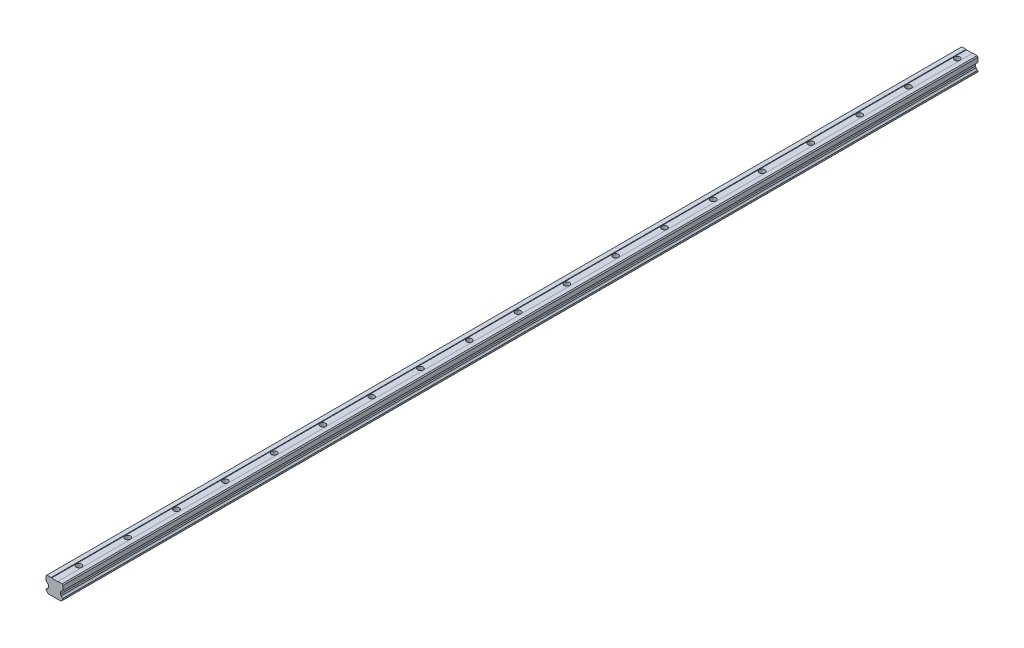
ISO-10303-21;
HEADER;
FILE_DESCRIPTION(('STEP AP214'),'2;1');
FILE_NAME('part.step','',(''),(''),'','','');
FILE_SCHEMA(('AUTOMOTIVE_DESIGN { 1 0 10303 214 1 1 1 1 }'));
ENDSEC;
DATA;
#1=APPLICATION_CONTEXT('core data for automotive mechanical design processes');
#2=APPLICATION_PROTOCOL_DEFINITION('international standard','automotive_design',2000,#1);
#3=PRODUCT_CONTEXT('',#1,'mechanical');
#4=PRODUCT('Part','Part','',(#3));
#5=PRODUCT_RELATED_PRODUCT_CATEGORY('part','',(#4));
#6=PRODUCT_DEFINITION_FORMATION('','',#4);
#7=PRODUCT_DEFINITION_CONTEXT('part definition',#1,'design');
#8=PRODUCT_DEFINITION('design','',#6,#7);
#9=PRODUCT_DEFINITION_SHAPE('','',#8);
#10=(LENGTH_UNIT() NAMED_UNIT(*) SI_UNIT(.MILLI.,.METRE.));
#11=(NAMED_UNIT(*) PLANE_ANGLE_UNIT() SI_UNIT($,.RADIAN.));
#12=(NAMED_UNIT(*) SI_UNIT($,.STERADIAN.) SOLID_ANGLE_UNIT());
#13=UNCERTAINTY_MEASURE_WITH_UNIT(LENGTH_MEASURE(1.E-05),#10,'distance_accuracy_value','');
#14=(GEOMETRIC_REPRESENTATION_CONTEXT(3) GLOBAL_UNCERTAINTY_ASSIGNED_CONTEXT((#13)) GLOBAL_UNIT_ASSIGNED_CONTEXT((#10,
#11,#12)) REPRESENTATION_CONTEXT('',''));
#15=CARTESIAN_POINT('',(0.,0.,0.));
#16=DIRECTION('',(0.,0.,1.));
#17=DIRECTION('',(1.,0.,0.));
#18=AXIS2_PLACEMENT_3D('',#15,#16,#17);
#19=CARTESIAN_POINT('',(-13.4343145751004,17.6037643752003,-750.));
#20=DIRECTION('',(-0.707106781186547,-0.707106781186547,0.));
#21=DIRECTION('',(0.707106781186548,-0.707106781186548,0.));
#22=AXIS2_PLACEMENT_3D('',#19,#20,#21);
#23=PLANE('',#22);
#24=DIRECTION('',(0.,0.,1.));
#25=VECTOR('',#24,1.);
#26=CARTESIAN_POINT('',(-9.60000000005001,13.7694498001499,-750.));
#27=LINE('',#26,#25);
#28=CARTESIAN_POINT('',(-9.60000000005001,13.7694498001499,-750.));
#29=VERTEX_POINT('',#28);
#30=CARTESIAN_POINT('',(-9.60000000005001,13.7694498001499,750.));
#31=VERTEX_POINT('',#30);
#32=EDGE_CURVE('E227',#29,#31,#27,.T.);
#33=ORIENTED_EDGE('',*,*,#32,.T.);
#34=DIRECTION('',(0.707106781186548,-0.707106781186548,0.));
#35=VECTOR('',#34,1.);
#36=CARTESIAN_POINT('',(-13.4343145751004,17.6037643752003,750.));
#37=LINE('',#36,#35);
#38=CARTESIAN_POINT('',(-13.4343145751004,17.6037643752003,750.));
#39=VERTEX_POINT('',#38);
#40=EDGE_CURVE('E230',#39,#31,#37,.T.);
#41=ORIENTED_EDGE('',*,*,#40,.F.);
#42=DIRECTION('',(0.,0.,1.));
#43=VECTOR('',#42,1.);
#44=CARTESIAN_POINT('',(-13.4343145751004,17.6037643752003,-750.));
#45=LINE('',#44,#43);
#46=CARTESIAN_POINT('',(-13.4343145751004,17.6037643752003,-750.));
#47=VERTEX_POINT('',#46);
#48=EDGE_CURVE('E11',#47,#39,#45,.T.);
#49=ORIENTED_EDGE('',*,*,#48,.F.);
#50=DIRECTION('',(0.707106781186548,-0.707106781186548,0.));
#51=VECTOR('',#50,1.);
#52=CARTESIAN_POINT('',(-13.4343145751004,17.6037643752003,-750.));
#53=LINE('',#52,#51);
#54=EDGE_CURVE('E231',#47,#29,#53,.T.);
#55=ORIENTED_EDGE('',*,*,#54,.T.);
#56=EDGE_LOOP('',(#33,#41,#49,#55));
#57=FACE_BOUND('',#56,.T.);
#58=ADVANCED_FACE('F33',(#57),#23,.T.);
#59=CARTESIAN_POINT('',(-13.9999999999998,17.6037643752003,-750.));
#60=DIRECTION('',(0.,-1.,0.));
#61=DIRECTION('',(0.,0.,-1.));
#62=AXIS2_PLACEMENT_3D('',#59,#60,#61);
#63=PLANE('',#62);
#64=ORIENTED_EDGE('',*,*,#48,.T.);
#65=DIRECTION('',(1.,0.,0.));
#66=VECTOR('',#65,1.);
#67=CARTESIAN_POINT('',(-13.9999999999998,17.6037643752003,750.));
#68=LINE('',#67,#66);
#69=CARTESIAN_POINT('',(-13.9999999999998,17.6037643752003,750.));
#70=VERTEX_POINT('',#69);
#71=EDGE_CURVE('E249',#70,#39,#68,.T.);
#72=ORIENTED_EDGE('',*,*,#71,.F.);
#73=DIRECTION('',(0.,0.,1.));
#74=VECTOR('',#73,1.);
#75=CARTESIAN_POINT('',(-13.9999999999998,17.6037643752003,-750.));
#76=LINE('',#75,#74);
#77=CARTESIAN_POINT('',(-13.9999999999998,17.6037643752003,-750.));
#78=VERTEX_POINT('',#77);
#79=EDGE_CURVE('E41',#78,#70,#76,.T.);
#80=ORIENTED_EDGE('',*,*,#79,.F.);
#81=DIRECTION('',(1.,0.,0.));
#82=VECTOR('',#81,1.);
#83=CARTESIAN_POINT('',(-13.9999999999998,17.6037643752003,-750.));
#84=LINE('',#83,#82);
#85=EDGE_CURVE('E236',#78,#47,#84,.T.);
#86=ORIENTED_EDGE('',*,*,#85,.T.);
#87=EDGE_LOOP('',(#64,#72,#80,#86));
#88=FACE_BOUND('',#87,.T.);
#89=ADVANCED_FACE('F706',(#88),#63,.T.);
#90=CARTESIAN_POINT('',(-13.9999999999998,25.1036943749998,-750.));
#91=DIRECTION('',(-1.,0.,0.));
#92=DIRECTION('',(0.,0.,1.));
#93=AXIS2_PLACEMENT_3D('',#90,#91,#92);
#94=PLANE('',#93);
#95=ORIENTED_EDGE('',*,*,#79,.T.);
#96=DIRECTION('',(0.,-1.,0.));
#97=VECTOR('',#96,1.);
#98=CARTESIAN_POINT('',(-13.9999999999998,25.1036943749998,750.));
#99=LINE('',#98,#97);
#100=CARTESIAN_POINT('',(-13.9999999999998,25.1036943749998,750.));
#101=VERTEX_POINT('',#100);
#102=EDGE_CURVE('E334',#101,#70,#99,.T.);
#103=ORIENTED_EDGE('',*,*,#102,.F.);
#104=DIRECTION('',(0.,0.,1.));
#105=VECTOR('',#104,1.);
#106=CARTESIAN_POINT('',(-13.9999999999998,25.1036943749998,-750.));
#107=LINE('',#106,#105);
#108=CARTESIAN_POINT('',(-13.9999999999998,25.1036943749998,-750.));
#109=VERTEX_POINT('',#108);
#110=EDGE_CURVE('E422',#109,#101,#107,.T.);
#111=ORIENTED_EDGE('',*,*,#110,.F.);
#112=DIRECTION('',(0.,-1.,0.));
#113=VECTOR('',#112,1.);
#114=CARTESIAN_POINT('',(-13.9999999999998,25.1036943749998,-750.));
#115=LINE('',#114,#113);
#116=EDGE_CURVE('E418',#109,#78,#115,.T.);
#117=ORIENTED_EDGE('',*,*,#116,.T.);
#118=EDGE_LOOP('',(#95,#103,#111,#117));
#119=FACE_BOUND('',#118,.T.);
#120=ADVANCED_FACE('F710',(#119),#94,.T.);
#121=CARTESIAN_POINT('',(-13.9999999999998,25.1036943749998,-750.));
#122=DIRECTION('',(-0.70710866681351,0.707104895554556,0.));
#123=DIRECTION('',(-0.707104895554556,-0.70710866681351,0.));
#124=AXIS2_PLACEMENT_3D('',#121,#122,#123);
#125=PLANE('',#124);
#126=ORIENTED_EDGE('',*,*,#110,.T.);
#127=DIRECTION('',(-0.707104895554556,-0.70710866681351,0.));
#128=VECTOR('',#127,1.);
#129=CARTESIAN_POINT('',(-13.9999999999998,25.1036943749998,750.));
#130=LINE('',#129,#128);
#131=CARTESIAN_POINT('',(-12.4999380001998,26.6037643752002,750.));
#132=VERTEX_POINT('',#131);
#133=EDGE_CURVE('E331',#132,#101,#130,.T.);
#134=ORIENTED_EDGE('',*,*,#133,.F.);
#135=DIRECTION('',(0.,0.,1.));
#136=VECTOR('',#135,1.);
#137=CARTESIAN_POINT('',(-12.4999380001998,26.6037643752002,-750.));
#138=LINE('',#137,#136);
#139=CARTESIAN_POINT('',(-12.4999380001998,26.6037643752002,-750.));
#140=VERTEX_POINT('',#139);
#141=EDGE_CURVE('E424',#140,#132,#138,.T.);
#142=ORIENTED_EDGE('',*,*,#141,.F.);
#143=DIRECTION('',(-0.707104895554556,-0.70710866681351,0.));
#144=VECTOR('',#143,1.);
#145=CARTESIAN_POINT('',(-13.9999999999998,25.1036943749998,-750.));
#146=LINE('',#145,#144);
#147=EDGE_CURVE('E415',#140,#109,#146,.T.);
#148=ORIENTED_EDGE('',*,*,#147,.T.);
#149=EDGE_LOOP('',(#126,#134,#142,#148));
#150=FACE_BOUND('',#149,.T.);
#151=ADVANCED_FACE('F715',(#150),#125,.T.);
#152=CARTESIAN_POINT('',(-12.4999380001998,26.6037643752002,-750.));
#153=DIRECTION('',(0.,1.,0.));
#154=DIRECTION('',(0.,0.,1.));
#155=AXIS2_PLACEMENT_3D('',#152,#153,#154);
#156=PLANE('',#155);
#157=ORIENTED_EDGE('',*,*,#141,.T.);
#158=DIRECTION('',(-1.,0.,0.));
#159=VECTOR('',#158,1.);
#160=CARTESIAN_POINT('',(-12.4999380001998,26.6037643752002,750.));
#161=LINE('',#160,#159);
#162=CARTESIAN_POINT('',(-5.50000000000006,26.6037643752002,750.));
#163=VERTEX_POINT('',#162);
#164=EDGE_CURVE('E328',#163,#132,#161,.T.);
#165=ORIENTED_EDGE('',*,*,#164,.F.);
#166=DIRECTION('',(0.,0.,1.));
#167=VECTOR('',#166,1.);
#168=CARTESIAN_POINT('',(-5.50000000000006,26.6037643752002,-750.));
#169=LINE('',#168,#167);
#170=CARTESIAN_POINT('',(-5.50000000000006,26.6037643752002,-750.));
#171=VERTEX_POINT('',#170);
#172=EDGE_CURVE('E426',#171,#163,#169,.T.);
#173=ORIENTED_EDGE('',*,*,#172,.F.);
#174=DIRECTION('',(-1.,0.,0.));
#175=VECTOR('',#174,1.);
#176=CARTESIAN_POINT('',(-12.4999380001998,26.6037643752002,-750.));
#177=LINE('',#176,#175);
#178=EDGE_CURVE('E412',#171,#140,#177,.T.);
#179=ORIENTED_EDGE('',*,*,#178,.T.);
#180=EDGE_LOOP('',(#157,#165,#173,#179));
#181=FACE_BOUND('',#180,.T.);
#182=ADVANCED_FACE('F724',(#181),#156,.T.);
#183=CARTESIAN_POINT('',(-4.99999999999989,26.1037643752,-750.));
#184=DIRECTION('',(0.707106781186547,0.707106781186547,0.));
#185=DIRECTION('',(-0.707106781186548,0.707106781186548,0.));
#186=AXIS2_PLACEMENT_3D('',#183,#184,#185);
#187=PLANE('',#186);
#188=ORIENTED_EDGE('',*,*,#172,.T.);
#189=DIRECTION('',(-0.707106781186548,0.707106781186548,0.));
#190=VECTOR('',#189,1.);
#191=CARTESIAN_POINT('',(-4.99999999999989,26.1037643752,750.));
#192=LINE('',#191,#190);
#193=CARTESIAN_POINT('',(-4.99999999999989,26.1037643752,750.));
#194=VERTEX_POINT('',#193);
#195=EDGE_CURVE('E325',#194,#163,#192,.T.);
#196=ORIENTED_EDGE('',*,*,#195,.F.);
#197=DIRECTION('',(0.,0.,1.));
#198=VECTOR('',#197,1.);
#199=CARTESIAN_POINT('',(-4.99999999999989,26.1037643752,-750.));
#200=LINE('',#199,#198);
#201=CARTESIAN_POINT('',(-4.99999999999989,26.1037643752,-750.));
#202=VERTEX_POINT('',#201);
#203=EDGE_CURVE('E428',#202,#194,#200,.T.);
#204=ORIENTED_EDGE('',*,*,#203,.F.);
#205=DIRECTION('',(-0.707106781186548,0.707106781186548,0.));
#206=VECTOR('',#205,1.);
#207=CARTESIAN_POINT('',(-4.99999999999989,26.1037643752,-750.));
#208=LINE('',#207,#206);
#209=EDGE_CURVE('E409',#202,#171,#208,.T.);
#210=ORIENTED_EDGE('',*,*,#209,.T.);
#211=EDGE_LOOP('',(#188,#196,#204,#210));
#212=FACE_BOUND('',#211,.T.);
#213=ADVANCED_FACE('F728',(#212),#187,.T.);
#214=CARTESIAN_POINT('',(-4.99999999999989,26.1037643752,-750.));
#215=DIRECTION('',(0.,1.,0.));
#216=DIRECTION('',(0.,0.,1.));
#217=AXIS2_PLACEMENT_3D('',#214,#215,#216);
#218=PLANE('',#217);
#219=CARTESIAN_POINT('',(2.09901540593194E-13,26.1037643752,-730.));
#220=DIRECTION('',(0.,1.,0.));
#221=DIRECTION('',(0.,0.,1.));
#222=AXIS2_PLACEMENT_3D('',#219,#220,#221);
#223=CIRCLE('',#222,4.5);
#224=CARTESIAN_POINT('',(2.09901540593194E-13,26.1037643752,-725.5));
#225=VERTEX_POINT('',#224);
#226=EDGE_CURVE('E36',#225,#225,#223,.T.);
#227=ORIENTED_EDGE('',*,*,#226,.F.);
#228=EDGE_LOOP('',(#227));
#229=FACE_BOUND('',#228,.T.);
#230=CARTESIAN_POINT('',(2.09901540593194E-13,26.1037643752,-650.));
#231=DIRECTION('',(0.,1.,0.));
#232=DIRECTION('',(0.,0.,1.));
#233=AXIS2_PLACEMENT_3D('',#230,#231,#232);
#234=CIRCLE('',#233,4.5);
#235=CARTESIAN_POINT('',(2.09901540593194E-13,26.1037643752,-645.5));
#236=VERTEX_POINT('',#235);
#237=EDGE_CURVE('E554',#236,#236,#234,.T.);
#238=ORIENTED_EDGE('',*,*,#237,.F.);
#239=EDGE_LOOP('',(#238));
#240=FACE_BOUND('',#239,.T.);
#241=CARTESIAN_POINT('',(2.09901540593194E-13,26.1037643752,-570.));
#242=DIRECTION('',(0.,1.,0.));
#243=DIRECTION('',(0.,0.,1.));
#244=AXIS2_PLACEMENT_3D('',#241,#242,#243);
#245=CIRCLE('',#244,4.5);
#246=CARTESIAN_POINT('',(2.09901540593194E-13,26.1037643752,-565.5));
#247=VERTEX_POINT('',#246);
#248=EDGE_CURVE('E550',#247,#247,#245,.T.);
#249=ORIENTED_EDGE('',*,*,#248,.F.);
#250=EDGE_LOOP('',(#249));
#251=FACE_BOUND('',#250,.T.);
#252=CARTESIAN_POINT('',(2.09901540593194E-13,26.1037643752,-490.));
#253=DIRECTION('',(0.,1.,0.));
#254=DIRECTION('',(0.,0.,1.));
#255=AXIS2_PLACEMENT_3D('',#252,#253,#254);
#256=CIRCLE('',#255,4.5);
#257=CARTESIAN_POINT('',(2.09901540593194E-13,26.1037643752,-485.5));
#258=VERTEX_POINT('',#257);
#259=EDGE_CURVE('E545',#258,#258,#256,.T.);
#260=ORIENTED_EDGE('',*,*,#259,.F.);
#261=EDGE_LOOP('',(#260));
#262=FACE_BOUND('',#261,.T.);
#263=CARTESIAN_POINT('',(2.09901540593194E-13,26.1037643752,-410.));
#264=DIRECTION('',(0.,1.,0.));
#265=DIRECTION('',(0.,0.,1.));
#266=AXIS2_PLACEMENT_3D('',#263,#264,#265);
#267=CIRCLE('',#266,4.5);
#268=CARTESIAN_POINT('',(2.09901540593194E-13,26.1037643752,-405.5));
#269=VERTEX_POINT('',#268);
#270=EDGE_CURVE('E540',#269,#269,#267,.T.);
#271=ORIENTED_EDGE('',*,*,#270,.F.);
#272=EDGE_LOOP('',(#271));
#273=FACE_BOUND('',#272,.T.);
#274=CARTESIAN_POINT('',(2.09901540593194E-13,26.1037643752,-330.));
#275=DIRECTION('',(0.,1.,0.));
#276=DIRECTION('',(0.,0.,1.));
#277=AXIS2_PLACEMENT_3D('',#274,#275,#276);
#278=CIRCLE('',#277,4.5);
#279=CARTESIAN_POINT('',(2.09901540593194E-13,26.1037643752,-325.5));
#280=VERTEX_POINT('',#279);
#281=EDGE_CURVE('E535',#280,#280,#278,.T.);
#282=ORIENTED_EDGE('',*,*,#281,.F.);
#283=EDGE_LOOP('',(#282));
#284=FACE_BOUND('',#283,.T.);
#285=CARTESIAN_POINT('',(2.09901540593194E-13,26.1037643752,-250.));
#286=DIRECTION('',(0.,1.,0.));
#287=DIRECTION('',(0.,0.,1.));
#288=AXIS2_PLACEMENT_3D('',#285,#286,#287);
#289=CIRCLE('',#288,4.5);
#290=CARTESIAN_POINT('',(2.09901540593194E-13,26.1037643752,-245.5));
#291=VERTEX_POINT('',#290);
#292=EDGE_CURVE('E530',#291,#291,#289,.T.);
#293=ORIENTED_EDGE('',*,*,#292,.F.);
#294=EDGE_LOOP('',(#293));
#295=FACE_BOUND('',#294,.T.);
#296=CARTESIAN_POINT('',(2.09901540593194E-13,26.1037643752,-170.));
#297=DIRECTION('',(0.,1.,0.));
#298=DIRECTION('',(0.,0.,1.));
#299=AXIS2_PLACEMENT_3D('',#296,#297,#298);
#300=CIRCLE('',#299,4.5);
#301=CARTESIAN_POINT('',(2.09901540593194E-13,26.1037643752,-165.5));
#302=VERTEX_POINT('',#301);
#303=EDGE_CURVE('E525',#302,#302,#300,.T.);
#304=ORIENTED_EDGE('',*,*,#303,.F.);
#305=EDGE_LOOP('',(#304));
#306=FACE_BOUND('',#305,.T.);
#307=CARTESIAN_POINT('',(2.09901540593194E-13,26.1037643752,-90.0000000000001));
#308=DIRECTION('',(0.,1.,0.));
#309=DIRECTION('',(0.,0.,1.));
#310=AXIS2_PLACEMENT_3D('',#307,#308,#309);
#311=CIRCLE('',#310,4.5);
#312=CARTESIAN_POINT('',(2.09901540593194E-13,26.1037643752,-85.5000000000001));
#313=VERTEX_POINT('',#312);
#314=EDGE_CURVE('E520',#313,#313,#311,.T.);
#315=ORIENTED_EDGE('',*,*,#314,.F.);
#316=EDGE_LOOP('',(#315));
#317=FACE_BOUND('',#316,.T.);
#318=CARTESIAN_POINT('',(2.09901540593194E-13,26.1037643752,-10.));
#319=DIRECTION('',(0.,1.,0.));
#320=DIRECTION('',(0.,0.,1.));
#321=AXIS2_PLACEMENT_3D('',#318,#319,#320);
#322=CIRCLE('',#321,4.5);
#323=CARTESIAN_POINT('',(2.09901540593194E-13,26.1037643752,-5.50000000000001));
#324=VERTEX_POINT('',#323);
#325=EDGE_CURVE('E515',#324,#324,#322,.T.);
#326=ORIENTED_EDGE('',*,*,#325,.F.);
#327=EDGE_LOOP('',(#326));
#328=FACE_BOUND('',#327,.T.);
#329=CARTESIAN_POINT('',(2.09901540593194E-13,26.1037643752,70.));
#330=DIRECTION('',(0.,1.,0.));
#331=DIRECTION('',(0.,0.,1.));
#332=AXIS2_PLACEMENT_3D('',#329,#330,#331);
#333=CIRCLE('',#332,4.5);
#334=CARTESIAN_POINT('',(2.09901540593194E-13,26.1037643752,74.5));
#335=VERTEX_POINT('',#334);
#336=EDGE_CURVE('E510',#335,#335,#333,.T.);
#337=ORIENTED_EDGE('',*,*,#336,.F.);
#338=EDGE_LOOP('',(#337));
#339=FACE_BOUND('',#338,.T.);
#340=CARTESIAN_POINT('',(2.09901540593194E-13,26.1037643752,150.));
#341=DIRECTION('',(0.,1.,0.));
#342=DIRECTION('',(0.,0.,1.));
#343=AXIS2_PLACEMENT_3D('',#340,#341,#342);
#344=CIRCLE('',#343,4.5);
#345=CARTESIAN_POINT('',(2.09901540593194E-13,26.1037643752,154.5));
#346=VERTEX_POINT('',#345);
#347=EDGE_CURVE('E505',#346,#346,#344,.T.);
#348=ORIENTED_EDGE('',*,*,#347,.F.);
#349=EDGE_LOOP('',(#348));
#350=FACE_BOUND('',#349,.T.);
#351=CARTESIAN_POINT('',(2.09901540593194E-13,26.1037643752,230.));
#352=DIRECTION('',(0.,1.,0.));
#353=DIRECTION('',(0.,0.,1.));
#354=AXIS2_PLACEMENT_3D('',#351,#352,#353);
#355=CIRCLE('',#354,4.5);
#356=CARTESIAN_POINT('',(2.09901540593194E-13,26.1037643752,234.5));
#357=VERTEX_POINT('',#356);
#358=EDGE_CURVE('E500',#357,#357,#355,.T.);
#359=ORIENTED_EDGE('',*,*,#358,.F.);
#360=EDGE_LOOP('',(#359));
#361=FACE_BOUND('',#360,.T.);
#362=CARTESIAN_POINT('',(2.09901540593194E-13,26.1037643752,310.));
#363=DIRECTION('',(0.,1.,0.));
#364=DIRECTION('',(0.,0.,1.));
#365=AXIS2_PLACEMENT_3D('',#362,#363,#364);
#366=CIRCLE('',#365,4.5);
#367=CARTESIAN_POINT('',(2.09901540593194E-13,26.1037643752,314.5));
#368=VERTEX_POINT('',#367);
#369=EDGE_CURVE('E495',#368,#368,#366,.T.);
#370=ORIENTED_EDGE('',*,*,#369,.F.);
#371=EDGE_LOOP('',(#370));
#372=FACE_BOUND('',#371,.T.);
#373=CARTESIAN_POINT('',(2.09901540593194E-13,26.1037643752,390.));
#374=DIRECTION('',(0.,1.,0.));
#375=DIRECTION('',(0.,0.,1.));
#376=AXIS2_PLACEMENT_3D('',#373,#374,#375);
#377=CIRCLE('',#376,4.5);
#378=CARTESIAN_POINT('',(2.09901540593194E-13,26.1037643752,394.5));
#379=VERTEX_POINT('',#378);
#380=EDGE_CURVE('E490',#379,#379,#377,.T.);
#381=ORIENTED_EDGE('',*,*,#380,.F.);
#382=EDGE_LOOP('',(#381));
#383=FACE_BOUND('',#382,.T.);
#384=CARTESIAN_POINT('',(2.09901540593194E-13,26.1037643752,470.));
#385=DIRECTION('',(0.,1.,0.));
#386=DIRECTION('',(0.,0.,1.));
#387=AXIS2_PLACEMENT_3D('',#384,#385,#386);
#388=CIRCLE('',#387,4.5);
#389=CARTESIAN_POINT('',(2.09901540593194E-13,26.1037643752,474.5));
#390=VERTEX_POINT('',#389);
#391=EDGE_CURVE('E485',#390,#390,#388,.T.);
#392=ORIENTED_EDGE('',*,*,#391,.F.);
#393=EDGE_LOOP('',(#392));
#394=FACE_BOUND('',#393,.T.);
#395=CARTESIAN_POINT('',(2.09901540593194E-13,26.1037643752,550.));
#396=DIRECTION('',(0.,1.,0.));
#397=DIRECTION('',(0.,0.,1.));
#398=AXIS2_PLACEMENT_3D('',#395,#396,#397);
#399=CIRCLE('',#398,4.5);
#400=CARTESIAN_POINT('',(2.09901540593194E-13,26.1037643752,554.5));
#401=VERTEX_POINT('',#400);
#402=EDGE_CURVE('E480',#401,#401,#399,.T.);
#403=ORIENTED_EDGE('',*,*,#402,.F.);
#404=EDGE_LOOP('',(#403));
#405=FACE_BOUND('',#404,.T.);
#406=CARTESIAN_POINT('',(2.09901540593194E-13,26.1037643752,630.));
#407=DIRECTION('',(0.,1.,0.));
#408=DIRECTION('',(0.,0.,1.));
#409=AXIS2_PLACEMENT_3D('',#406,#407,#408);
#410=CIRCLE('',#409,4.5);
#411=CARTESIAN_POINT('',(2.09901540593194E-13,26.1037643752,634.5));
#412=VERTEX_POINT('',#411);
#413=EDGE_CURVE('E475',#412,#412,#410,.T.);
#414=ORIENTED_EDGE('',*,*,#413,.F.);
#415=EDGE_LOOP('',(#414));
#416=FACE_BOUND('',#415,.T.);
#417=CARTESIAN_POINT('',(2.09901540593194E-13,26.1037643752,710.));
#418=DIRECTION('',(0.,1.,0.));
#419=DIRECTION('',(0.,0.,1.));
#420=AXIS2_PLACEMENT_3D('',#417,#418,#419);
#421=CIRCLE('',#420,4.5);
#422=CARTESIAN_POINT('',(2.09901540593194E-13,26.1037643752,714.5));
#423=VERTEX_POINT('',#422);
#424=EDGE_CURVE('E250',#423,#423,#421,.T.);
#425=ORIENTED_EDGE('',*,*,#424,.F.);
#426=EDGE_LOOP('',(#425));
#427=FACE_BOUND('',#426,.T.);
#428=ORIENTED_EDGE('',*,*,#203,.T.);
#429=DIRECTION('',(-1.,0.,0.));
#430=VECTOR('',#429,1.);
#431=CARTESIAN_POINT('',(-4.99999999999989,26.1037643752,750.));
#432=LINE('',#431,#430);
#433=CARTESIAN_POINT('',(4.99999999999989,26.1037643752,750.));
#434=VERTEX_POINT('',#433);
#435=EDGE_CURVE('E322',#434,#194,#432,.T.);
#436=ORIENTED_EDGE('',*,*,#435,.F.);
#437=DIRECTION('',(0.,0.,1.));
#438=VECTOR('',#437,1.);
#439=CARTESIAN_POINT('',(4.99999999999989,26.1037643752,-750.));
#440=LINE('',#439,#438);
#441=CARTESIAN_POINT('',(4.99999999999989,26.1037643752,-750.));
#442=VERTEX_POINT('',#441);
#443=EDGE_CURVE('E430',#442,#434,#440,.T.);
#444=ORIENTED_EDGE('',*,*,#443,.F.);
#445=DIRECTION('',(-1.,0.,0.));
#446=VECTOR('',#445,1.);
#447=CARTESIAN_POINT('',(-4.99999999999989,26.1037643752,-750.));
#448=LINE('',#447,#446);
#449=EDGE_CURVE('E406',#442,#202,#448,.T.);
#450=ORIENTED_EDGE('',*,*,#449,.T.);
#451=EDGE_LOOP('',(#428,#436,#444,#450));
#452=FACE_BOUND('',#451,.T.);
#453=ADVANCED_FACE('F732',(#229,#240,#251,#262,#273,#284,#295,#306,#317,#328,#339,#350,#361,
#372,#383,#394,#405,#416,#427,#452),#218,.T.);
#454=CARTESIAN_POINT('',(4.99999999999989,26.1037643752,-750.));
#455=DIRECTION('',(-0.707106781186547,0.707106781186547,0.));
#456=DIRECTION('',(-0.707106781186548,-0.707106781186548,0.));
#457=AXIS2_PLACEMENT_3D('',#454,#455,#456);
#458=PLANE('',#457);
#459=ORIENTED_EDGE('',*,*,#443,.T.);
#460=DIRECTION('',(-0.707106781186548,-0.707106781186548,0.));
#461=VECTOR('',#460,1.);
#462=CARTESIAN_POINT('',(4.99999999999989,26.1037643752,750.));
#463=LINE('',#462,#461);
#464=CARTESIAN_POINT('',(5.50000000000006,26.6037643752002,750.));
#465=VERTEX_POINT('',#464);
#466=EDGE_CURVE('E319',#465,#434,#463,.T.);
#467=ORIENTED_EDGE('',*,*,#466,.F.);
#468=DIRECTION('',(0.,0.,1.));
#469=VECTOR('',#468,1.);
#470=CARTESIAN_POINT('',(5.50000000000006,26.6037643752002,-750.));
#471=LINE('',#470,#469);
#472=CARTESIAN_POINT('',(5.50000000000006,26.6037643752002,-750.));
#473=VERTEX_POINT('',#472);
#474=EDGE_CURVE('E432',#473,#465,#471,.T.);
#475=ORIENTED_EDGE('',*,*,#474,.F.);
#476=DIRECTION('',(-0.707106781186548,-0.707106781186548,0.));
#477=VECTOR('',#476,1.);
#478=CARTESIAN_POINT('',(4.99999999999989,26.1037643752,-750.));
#479=LINE('',#478,#477);
#480=EDGE_CURVE('E403',#473,#442,#479,.T.);
#481=ORIENTED_EDGE('',*,*,#480,.T.);
#482=EDGE_LOOP('',(#459,#467,#475,#481));
#483=FACE_BOUND('',#482,.T.);
#484=ADVANCED_FACE('F736',(#483),#458,.T.);
#485=CARTESIAN_POINT('',(5.50000000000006,26.6037643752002,-750.));
#486=DIRECTION('',(0.,1.,0.));
#487=DIRECTION('',(0.,0.,1.));
#488=AXIS2_PLACEMENT_3D('',#485,#486,#487);
#489=PLANE('',#488);
#490=ORIENTED_EDGE('',*,*,#474,.T.);
#491=DIRECTION('',(-1.,0.,0.));
#492=VECTOR('',#491,1.);
#493=CARTESIAN_POINT('',(5.50000000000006,26.6037643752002,750.));
#494=LINE('',#493,#492);
#495=CARTESIAN_POINT('',(12.4999999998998,26.6037643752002,750.));
#496=VERTEX_POINT('',#495);
#497=EDGE_CURVE('E316',#496,#465,#494,.T.);
#498=ORIENTED_EDGE('',*,*,#497,.F.);
#499=DIRECTION('',(0.,0.,1.));
#500=VECTOR('',#499,1.);
#501=CARTESIAN_POINT('',(12.4999999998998,26.6037643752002,-750.));
#502=LINE('',#501,#500);
#503=CARTESIAN_POINT('',(12.4999999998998,26.6037643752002,-750.));
#504=VERTEX_POINT('',#503);
#505=EDGE_CURVE('E434',#504,#496,#502,.T.);
#506=ORIENTED_EDGE('',*,*,#505,.F.);
#507=DIRECTION('',(-1.,0.,0.));
#508=VECTOR('',#507,1.);
#509=CARTESIAN_POINT('',(5.50000000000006,26.6037643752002,-750.));
#510=LINE('',#509,#508);
#511=EDGE_CURVE('E400',#504,#473,#510,.T.);
#512=ORIENTED_EDGE('',*,*,#511,.T.);
#513=EDGE_LOOP('',(#490,#498,#506,#512));
#514=FACE_BOUND('',#513,.T.);
#515=ADVANCED_FACE('F740',(#514),#489,.T.);
#516=CARTESIAN_POINT('',(12.4999999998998,26.6037643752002,-750.));
#517=DIRECTION('',(0.707106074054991,0.707107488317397,0.));
#518=DIRECTION('',(-0.707107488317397,0.707106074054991,0.));
#519=AXIS2_PLACEMENT_3D('',#516,#517,#518);
#520=PLANE('',#519);
#521=ORIENTED_EDGE('',*,*,#505,.T.);
#522=DIRECTION('',(-0.707107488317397,0.707106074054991,0.));
#523=VECTOR('',#522,1.);
#524=CARTESIAN_POINT('',(12.4999999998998,26.6037643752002,750.));
#525=LINE('',#524,#523);
#526=CARTESIAN_POINT('',(14.0000000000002,25.1037673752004,750.));
#527=VERTEX_POINT('',#526);
#528=EDGE_CURVE('E313',#527,#496,#525,.T.);
#529=ORIENTED_EDGE('',*,*,#528,.F.);
#530=DIRECTION('',(0.,0.,1.));
#531=VECTOR('',#530,1.);
#532=CARTESIAN_POINT('',(14.0000000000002,25.1037673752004,-750.));
#533=LINE('',#532,#531);
#534=CARTESIAN_POINT('',(14.0000000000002,25.1037673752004,-750.));
#535=VERTEX_POINT('',#534);
#536=EDGE_CURVE('E436',#535,#527,#533,.T.);
#537=ORIENTED_EDGE('',*,*,#536,.F.);
#538=DIRECTION('',(-0.707107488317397,0.707106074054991,0.));
#539=VECTOR('',#538,1.);
#540=CARTESIAN_POINT('',(12.4999999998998,26.6037643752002,-750.));
#541=LINE('',#540,#539);
#542=EDGE_CURVE('E397',#535,#504,#541,.T.);
#543=ORIENTED_EDGE('',*,*,#542,.T.);
#544=EDGE_LOOP('',(#521,#529,#537,#543));
#545=FACE_BOUND('',#544,.T.);
#546=ADVANCED_FACE('F744',(#545),#520,.T.);
#547=CARTESIAN_POINT('',(14.0000000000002,17.55375237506,-750.));
#548=DIRECTION('',(1.,0.,0.));
#549=DIRECTION('',(0.,0.,-1.));
#550=AXIS2_PLACEMENT_3D('',#547,#548,#549);
#551=PLANE('',#550);
#552=ORIENTED_EDGE('',*,*,#536,.T.);
#553=DIRECTION('',(0.,1.,0.));
#554=VECTOR('',#553,1.);
#555=CARTESIAN_POINT('',(14.0000000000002,17.55375237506,750.));
#556=LINE('',#555,#554);
#557=CARTESIAN_POINT('',(14.0000000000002,17.55375237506,750.));
#558=VERTEX_POINT('',#557);
#559=EDGE_CURVE('E310',#558,#527,#556,.T.);
#560=ORIENTED_EDGE('',*,*,#559,.F.);
#561=DIRECTION('',(0.,0.,1.));
#562=VECTOR('',#561,1.);
#563=CARTESIAN_POINT('',(14.0000000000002,17.55375237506,-750.));
#564=LINE('',#563,#562);
#565=CARTESIAN_POINT('',(14.0000000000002,17.55375237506,-750.));
#566=VERTEX_POINT('',#565);
#567=EDGE_CURVE('E438',#566,#558,#564,.T.);
#568=ORIENTED_EDGE('',*,*,#567,.F.);
#569=DIRECTION('',(0.,1.,0.));
#570=VECTOR('',#569,1.);
#571=CARTESIAN_POINT('',(14.0000000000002,17.55375237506,-750.));
#572=LINE('',#571,#570);
#573=EDGE_CURVE('E394',#566,#535,#572,.T.);
#574=ORIENTED_EDGE('',*,*,#573,.T.);
#575=EDGE_LOOP('',(#552,#560,#568,#574));
#576=FACE_BOUND('',#575,.T.);
#577=ADVANCED_FACE('F748',(#576),#551,.T.);
#578=CARTESIAN_POINT('',(14.0000000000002,17.55375237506,-750.));
#579=DIRECTION('',(0.,-1.,0.));
#580=DIRECTION('',(0.,0.,-1.));
#581=AXIS2_PLACEMENT_3D('',#578,#579,#580);
#582=PLANE('',#581);
#583=ORIENTED_EDGE('',*,*,#567,.T.);
#584=DIRECTION('',(1.,0.,0.));
#585=VECTOR('',#584,1.);
#586=CARTESIAN_POINT('',(14.0000000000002,17.55375237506,750.));
#587=LINE('',#586,#585);
#588=CARTESIAN_POINT('',(13.3843025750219,17.55375237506,750.));
#589=VERTEX_POINT('',#588);
#590=EDGE_CURVE('E307',#589,#558,#587,.T.);
#591=ORIENTED_EDGE('',*,*,#590,.F.);
#592=DIRECTION('',(0.,0.,1.));
#593=VECTOR('',#592,1.);
#594=CARTESIAN_POINT('',(13.3843025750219,17.55375237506,-750.));
#595=LINE('',#594,#593);
#596=CARTESIAN_POINT('',(13.3843025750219,17.55375237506,-750.));
#597=VERTEX_POINT('',#596);
#598=EDGE_CURVE('E440',#597,#589,#595,.T.);
#599=ORIENTED_EDGE('',*,*,#598,.F.);
#600=DIRECTION('',(1.,0.,0.));
#601=VECTOR('',#600,1.);
#602=CARTESIAN_POINT('',(14.0000000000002,17.55375237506,-750.));
#603=LINE('',#602,#601);
#604=EDGE_CURVE('E391',#597,#566,#603,.T.);
#605=ORIENTED_EDGE('',*,*,#604,.T.);
#606=EDGE_LOOP('',(#583,#591,#599,#605));
#607=FACE_BOUND('',#606,.T.);
#608=ADVANCED_FACE('F752',(#607),#582,.T.);
#609=CARTESIAN_POINT('',(9.59999999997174,13.7694498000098,-750.));
#610=DIRECTION('',(0.707106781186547,-0.707106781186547,0.));
#611=DIRECTION('',(0.707106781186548,0.707106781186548,0.));
#612=AXIS2_PLACEMENT_3D('',#609,#610,#611);
#613=PLANE('',#612);
#614=ORIENTED_EDGE('',*,*,#598,.T.);
#615=DIRECTION('',(0.707106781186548,0.707106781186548,0.));
#616=VECTOR('',#615,1.);
#617=CARTESIAN_POINT('',(9.59999999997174,13.7694498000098,750.));
#618=LINE('',#617,#616);
#619=CARTESIAN_POINT('',(9.59999999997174,13.7694498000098,750.));
#620=VERTEX_POINT('',#619);
#621=EDGE_CURVE('E304',#620,#589,#618,.T.);
#622=ORIENTED_EDGE('',*,*,#621,.F.);
#623=DIRECTION('',(0.,0.,1.));
#624=VECTOR('',#623,1.);
#625=CARTESIAN_POINT('',(9.59999999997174,13.7694498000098,-750.));
#626=LINE('',#625,#624);
#627=CARTESIAN_POINT('',(9.59999999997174,13.7694498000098,-750.));
#628=VERTEX_POINT('',#627);
#629=EDGE_CURVE('E442',#628,#620,#626,.T.);
#630=ORIENTED_EDGE('',*,*,#629,.F.);
#631=DIRECTION('',(0.707106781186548,0.707106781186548,0.));
#632=VECTOR('',#631,1.);
#633=CARTESIAN_POINT('',(9.59999999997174,13.7694498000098,-750.));
#634=LINE('',#633,#632);
#635=EDGE_CURVE('E388',#628,#597,#634,.T.);
#636=ORIENTED_EDGE('',*,*,#635,.T.);
#637=EDGE_LOOP('',(#614,#622,#630,#636));
#638=FACE_BOUND('',#637,.T.);
#639=ADVANCED_FACE('F756',(#638),#613,.T.);
#640=CARTESIAN_POINT('',(9.59999999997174,10.1495174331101,-750.));
#641=DIRECTION('',(1.,0.,0.));
#642=DIRECTION('',(0.,0.,-1.));
#643=AXIS2_PLACEMENT_3D('',#640,#641,#642);
#644=PLANE('',#643);
#645=ORIENTED_EDGE('',*,*,#629,.T.);
#646=DIRECTION('',(0.,1.,0.));
#647=VECTOR('',#646,1.);
#648=CARTESIAN_POINT('',(9.59999999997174,10.1495174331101,750.));
#649=LINE('',#648,#647);
#650=CARTESIAN_POINT('',(9.59999999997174,10.1495174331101,750.));
#651=VERTEX_POINT('',#650);
#652=EDGE_CURVE('E301',#651,#620,#649,.T.);
#653=ORIENTED_EDGE('',*,*,#652,.F.);
#654=DIRECTION('',(0.,0.,1.));
#655=VECTOR('',#654,1.);
#656=CARTESIAN_POINT('',(9.59999999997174,10.1495174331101,-750.));
#657=LINE('',#656,#655);
#658=CARTESIAN_POINT('',(9.59999999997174,10.1495174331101,-750.));
#659=VERTEX_POINT('',#658);
#660=EDGE_CURVE('E444',#659,#651,#657,.T.);
#661=ORIENTED_EDGE('',*,*,#660,.F.);
#662=DIRECTION('',(0.,1.,0.));
#663=VECTOR('',#662,1.);
#664=CARTESIAN_POINT('',(9.59999999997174,10.1495174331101,-750.));
#665=LINE('',#664,#663);
#666=EDGE_CURVE('E385',#659,#628,#665,.T.);
#667=ORIENTED_EDGE('',*,*,#666,.T.);
#668=EDGE_LOOP('',(#645,#653,#661,#667));
#669=FACE_BOUND('',#668,.T.);
#670=ADVANCED_FACE('F760',(#669),#644,.T.);
#671=CARTESIAN_POINT('',(10.898782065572,8.85073536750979,-750.));
#672=DIRECTION('',(0.707106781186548,0.707106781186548,0.));
#673=DIRECTION('',(-0.707106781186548,0.707106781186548,0.));
#674=AXIS2_PLACEMENT_3D('',#671,#672,#673);
#675=PLANE('',#674);
#676=ORIENTED_EDGE('',*,*,#660,.T.);
#677=DIRECTION('',(-0.707106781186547,0.707106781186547,0.));
#678=VECTOR('',#677,1.);
#679=CARTESIAN_POINT('',(10.898782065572,8.85073536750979,750.));
#680=LINE('',#679,#678);
#681=CARTESIAN_POINT('',(10.898782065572,8.85073536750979,750.));
#682=VERTEX_POINT('',#681);
#683=EDGE_CURVE('E298',#682,#651,#680,.T.);
#684=ORIENTED_EDGE('',*,*,#683,.F.);
#685=DIRECTION('',(0.,0.,1.));
#686=VECTOR('',#685,1.);
#687=CARTESIAN_POINT('',(10.898782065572,8.85073536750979,-750.));
#688=LINE('',#687,#686);
#689=CARTESIAN_POINT('',(10.898782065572,8.85073536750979,-750.));
#690=VERTEX_POINT('',#689);
#691=EDGE_CURVE('E446',#690,#682,#688,.T.);
#692=ORIENTED_EDGE('',*,*,#691,.F.);
#693=DIRECTION('',(-0.707106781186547,0.707106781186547,0.));
#694=VECTOR('',#693,1.);
#695=CARTESIAN_POINT('',(10.898782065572,8.85073536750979,-750.));
#696=LINE('',#695,#694);
#697=EDGE_CURVE('E382',#690,#659,#696,.T.);
#698=ORIENTED_EDGE('',*,*,#697,.T.);
#699=EDGE_LOOP('',(#676,#684,#692,#698));
#700=FACE_BOUND('',#699,.T.);
#701=ADVANCED_FACE('F764',(#700),#675,.T.);
#702=CARTESIAN_POINT('',(14.0818479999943,9.67876037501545,-750.));
#703=DIRECTION('',(0.,0.,1.));
#704=DIRECTION('',(1.,0.,0.));
#705=AXIS2_PLACEMENT_3D('',#702,#703,#704);
#706=CYLINDRICAL_SURFACE('',#705,3.28900199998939);
#707=ORIENTED_EDGE('',*,*,#691,.T.);
#708=CARTESIAN_POINT('',(14.0818479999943,9.67876037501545,750.));
#709=DIRECTION('',(0.,0.,-1.));
#710=DIRECTION('',(1.,0.,0.));
#711=AXIS2_PLACEMENT_3D('',#708,#709,#710);
#712=CIRCLE('',#711,3.28900199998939);
#713=CARTESIAN_POINT('',(13.4390855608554,6.4531766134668,750.));
#714=VERTEX_POINT('',#713);
#715=EDGE_CURVE('E295',#714,#682,#712,.T.);
#716=ORIENTED_EDGE('',*,*,#715,.F.);
#717=DIRECTION('',(0.,0.,1.));
#718=VECTOR('',#717,1.);
#719=CARTESIAN_POINT('',(13.4390855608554,6.4531766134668,-750.));
#720=LINE('',#719,#718);
#721=CARTESIAN_POINT('',(13.4390855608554,6.4531766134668,-750.));
#722=VERTEX_POINT('',#721);
#723=EDGE_CURVE('E448',#722,#714,#720,.T.);
#724=ORIENTED_EDGE('',*,*,#723,.F.);
#725=CARTESIAN_POINT('',(14.0818479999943,9.67876037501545,-750.));
#726=DIRECTION('',(0.,0.,-1.));
#727=DIRECTION('',(1.,0.,0.));
#728=AXIS2_PLACEMENT_3D('',#725,#726,#727);
#729=CIRCLE('',#728,3.28900199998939);
#730=EDGE_CURVE('E379',#722,#690,#729,.T.);
#731=ORIENTED_EDGE('',*,*,#730,.T.);
#732=EDGE_LOOP('',(#707,#716,#724,#731));
#733=FACE_BOUND('',#732,.T.);
#734=ADVANCED_FACE('F768',(#733),#706,.F.);
#735=CARTESIAN_POINT('',(13.3999999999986,6.25703299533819,-750.));
#736=DIRECTION('',(0.,0.,1.));
#737=DIRECTION('',(1.,0.,0.));
#738=AXIS2_PLACEMENT_3D('',#735,#736,#737);
#739=CYLINDRICAL_SURFACE('',#738,0.200000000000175);
#740=ORIENTED_EDGE('',*,*,#723,.T.);
#741=CARTESIAN_POINT('',(13.3999999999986,6.25703299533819,750.));
#742=DIRECTION('',(0.,0.,1.));
#743=DIRECTION('',(1.,0.,0.));
#744=AXIS2_PLACEMENT_3D('',#741,#742,#743);
#745=CIRCLE('',#744,0.200000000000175);
#746=CARTESIAN_POINT('',(13.5999999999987,6.25703299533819,750.));
#747=VERTEX_POINT('',#746);
#748=EDGE_CURVE('E292',#747,#714,#745,.T.);
#749=ORIENTED_EDGE('',*,*,#748,.F.);
#750=DIRECTION('',(0.,0.,1.));
#751=VECTOR('',#750,1.);
#752=CARTESIAN_POINT('',(13.5999999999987,6.25703299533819,-750.));
#753=LINE('',#752,#751);
#754=CARTESIAN_POINT('',(13.5999999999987,6.25703299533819,-750.));
#755=VERTEX_POINT('',#754);
#756=EDGE_CURVE('E450',#755,#747,#753,.T.);
#757=ORIENTED_EDGE('',*,*,#756,.F.);
#758=CARTESIAN_POINT('',(13.3999999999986,6.25703299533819,-750.));
#759=DIRECTION('',(0.,0.,1.));
#760=DIRECTION('',(1.,0.,0.));
#761=AXIS2_PLACEMENT_3D('',#758,#759,#760);
#762=CIRCLE('',#761,0.200000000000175);
#763=EDGE_CURVE('E376',#755,#722,#762,.T.);
#764=ORIENTED_EDGE('',*,*,#763,.T.);
#765=EDGE_LOOP('',(#740,#749,#757,#764));
#766=FACE_BOUND('',#765,.T.);
#767=ADVANCED_FACE('F772',(#766),#739,.T.);
#768=CARTESIAN_POINT('',(13.5999999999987,3.95050873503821,-750.));
#769=DIRECTION('',(1.,0.,0.));
#770=DIRECTION('',(0.,0.,-1.));
#771=AXIS2_PLACEMENT_3D('',#768,#769,#770);
#772=PLANE('',#771);
#773=ORIENTED_EDGE('',*,*,#756,.T.);
#774=DIRECTION('',(0.,1.,0.));
#775=VECTOR('',#774,1.);
#776=CARTESIAN_POINT('',(13.5999999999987,3.95050873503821,750.));
#777=LINE('',#776,#775);
#778=CARTESIAN_POINT('',(13.5999999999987,3.95050873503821,750.));
#779=VERTEX_POINT('',#778);
#780=EDGE_CURVE('E289',#779,#747,#777,.T.);
#781=ORIENTED_EDGE('',*,*,#780,.F.);
#782=DIRECTION('',(0.,0.,1.));
#783=VECTOR('',#782,1.);
#784=CARTESIAN_POINT('',(13.5999999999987,3.95050873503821,-750.));
#785=LINE('',#784,#783);
#786=CARTESIAN_POINT('',(13.5999999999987,3.95050873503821,-750.));
#787=VERTEX_POINT('',#786);
#788=EDGE_CURVE('E452',#787,#779,#785,.T.);
#789=ORIENTED_EDGE('',*,*,#788,.F.);
#790=DIRECTION('',(0.,1.,0.));
#791=VECTOR('',#790,1.);
#792=CARTESIAN_POINT('',(13.5999999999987,3.95050873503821,-750.));
#793=LINE('',#792,#791);
#794=EDGE_CURVE('E373',#787,#755,#793,.T.);
#795=ORIENTED_EDGE('',*,*,#794,.T.);
#796=EDGE_LOOP('',(#773,#781,#789,#795));
#797=FACE_BOUND('',#796,.T.);
#798=ADVANCED_FACE('F776',(#797),#772,.T.);
#799=CARTESIAN_POINT('',(13.4000000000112,3.95050873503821,-750.));
#800=DIRECTION('',(0.,0.,1.));
#801=DIRECTION('',(1.,0.,0.));
#802=AXIS2_PLACEMENT_3D('',#799,#800,#801);
#803=CYLINDRICAL_SURFACE('',#802,0.199999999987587);
#804=ORIENTED_EDGE('',*,*,#788,.T.);
#805=CARTESIAN_POINT('',(13.4000000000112,3.95050873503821,750.));
#806=DIRECTION('',(0.,0.,1.));
#807=DIRECTION('',(1.,0.,0.));
#808=AXIS2_PLACEMENT_3D('',#805,#806,#807);
#809=CIRCLE('',#808,0.199999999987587);
#810=CARTESIAN_POINT('',(13.4390855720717,3.75436511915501,750.));
#811=VERTEX_POINT('',#810);
#812=EDGE_CURVE('E286',#811,#779,#809,.T.);
#813=ORIENTED_EDGE('',*,*,#812,.F.);
#814=DIRECTION('',(0.,0.,1.));
#815=VECTOR('',#814,1.);
#816=CARTESIAN_POINT('',(13.4390855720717,3.75436511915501,-750.));
#817=LINE('',#816,#815);
#818=CARTESIAN_POINT('',(13.4390855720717,3.75436511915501,-750.));
#819=VERTEX_POINT('',#818);
#820=EDGE_CURVE('E454',#819,#811,#817,.T.);
#821=ORIENTED_EDGE('',*,*,#820,.F.);
#822=CARTESIAN_POINT('',(13.4000000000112,3.95050873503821,-750.));
#823=DIRECTION('',(0.,0.,1.));
#824=DIRECTION('',(1.,0.,0.));
#825=AXIS2_PLACEMENT_3D('',#822,#823,#824);
#826=CIRCLE('',#825,0.199999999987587);
#827=EDGE_CURVE('E370',#819,#787,#826,.T.);
#828=ORIENTED_EDGE('',*,*,#827,.T.);
#829=EDGE_LOOP('',(#804,#813,#821,#828));
#830=FACE_BOUND('',#829,.T.);
#831=ADVANCED_FACE('F780',(#830),#803,.T.);
#832=CARTESIAN_POINT('',(14.0818480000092,0.528782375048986,-750.));
#833=DIRECTION('',(0.,0.,1.));
#834=DIRECTION('',(1.,0.,0.));
#835=AXIS2_PLACEMENT_3D('',#832,#833,#834);
#836=CYLINDRICAL_SURFACE('',#835,3.28900099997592);
#837=ORIENTED_EDGE('',*,*,#820,.T.);
#838=CARTESIAN_POINT('',(14.0818480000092,0.528782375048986,750.));
#839=DIRECTION('',(0.,0.,-1.));
#840=DIRECTION('',(1.,0.,0.));
#841=AXIS2_PLACEMENT_3D('',#838,#839,#840);
#842=CIRCLE('',#841,3.28900099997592);
#843=CARTESIAN_POINT('',(10.8987834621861,1.35680877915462,750.));
#844=VERTEX_POINT('',#843);
#845=EDGE_CURVE('E283',#844,#811,#842,.T.);
#846=ORIENTED_EDGE('',*,*,#845,.F.);
#847=DIRECTION('',(0.,0.,1.));
#848=VECTOR('',#847,1.);
#849=CARTESIAN_POINT('',(10.8987834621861,1.35680877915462,-750.));
#850=LINE('',#849,#848);
#851=CARTESIAN_POINT('',(10.8987834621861,1.35680877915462,-750.));
#852=VERTEX_POINT('',#851);
#853=EDGE_CURVE('E456',#852,#844,#850,.T.);
#854=ORIENTED_EDGE('',*,*,#853,.F.);
#855=CARTESIAN_POINT('',(14.0818480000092,0.528782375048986,-750.));
#856=DIRECTION('',(0.,0.,-1.));
#857=DIRECTION('',(1.,0.,0.));
#858=AXIS2_PLACEMENT_3D('',#855,#856,#857);
#859=CIRCLE('',#858,3.28900099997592);
#860=EDGE_CURVE('E367',#852,#819,#859,.T.);
#861=ORIENTED_EDGE('',*,*,#860,.T.);
#862=EDGE_LOOP('',(#837,#846,#854,#861));
#863=FACE_BOUND('',#862,.T.);
#864=ADVANCED_FACE('F784',(#863),#836,.F.);
#865=CARTESIAN_POINT('',(10.5457390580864,1.00376437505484,-750.));
#866=DIRECTION('',(0.707106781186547,-0.707106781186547,0.));
#867=DIRECTION('',(0.707106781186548,0.707106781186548,0.));
#868=AXIS2_PLACEMENT_3D('',#865,#866,#867);
#869=PLANE('',#868);
#870=ORIENTED_EDGE('',*,*,#853,.T.);
#871=DIRECTION('',(0.707106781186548,0.707106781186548,0.));
#872=VECTOR('',#871,1.);
#873=CARTESIAN_POINT('',(10.5457390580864,1.00376437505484,750.));
#874=LINE('',#873,#872);
#875=CARTESIAN_POINT('',(10.5457390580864,1.00376437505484,750.));
#876=VERTEX_POINT('',#875);
#877=EDGE_CURVE('E280',#876,#844,#874,.T.);
#878=ORIENTED_EDGE('',*,*,#877,.F.);
#879=DIRECTION('',(0.,0.,1.));
#880=VECTOR('',#879,1.);
#881=CARTESIAN_POINT('',(10.5457390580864,1.00376437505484,-750.));
#882=LINE('',#881,#880);
#883=CARTESIAN_POINT('',(10.5457390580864,1.00376437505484,-750.));
#884=VERTEX_POINT('',#883);
#885=EDGE_CURVE('E458',#884,#876,#882,.T.);
#886=ORIENTED_EDGE('',*,*,#885,.F.);
#887=DIRECTION('',(0.707106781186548,0.707106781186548,0.));
#888=VECTOR('',#887,1.);
#889=CARTESIAN_POINT('',(10.5457390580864,1.00376437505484,-750.));
#890=LINE('',#889,#888);
#891=EDGE_CURVE('E364',#884,#852,#890,.T.);
#892=ORIENTED_EDGE('',*,*,#891,.T.);
#893=EDGE_LOOP('',(#870,#878,#886,#892));
#894=FACE_BOUND('',#893,.T.);
#895=ADVANCED_FACE('F788',(#894),#869,.T.);
#896=CARTESIAN_POINT('',(-10.5457390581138,1.00376437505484,-750.));
#897=DIRECTION('',(0.,-1.,0.));
#898=DIRECTION('',(0.,0.,-1.));
#899=AXIS2_PLACEMENT_3D('',#896,#897,#898);
#900=PLANE('',#899);
#901=CARTESIAN_POINT('',(2.09901540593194E-13,1.00376437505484,-730.));
#902=DIRECTION('',(0.,-1.,0.));
#903=DIRECTION('',(0.,0.,-1.));
#904=AXIS2_PLACEMENT_3D('',#901,#902,#903);
#905=CIRCLE('',#904,7.5);
#906=CARTESIAN_POINT('',(2.09901540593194E-13,1.00376437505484,-737.5));
#907=VERTEX_POINT('',#906);
#908=EDGE_CURVE('E1468',#907,#907,#905,.T.);
#909=ORIENTED_EDGE('',*,*,#908,.F.);
#910=EDGE_LOOP('',(#909));
#911=FACE_BOUND('',#910,.T.);
#912=CARTESIAN_POINT('',(2.09901540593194E-13,1.00376437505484,-650.));
#913=DIRECTION('',(0.,-1.,0.));
#914=DIRECTION('',(0.,0.,-1.));
#915=AXIS2_PLACEMENT_3D('',#912,#913,#914);
#916=CIRCLE('',#915,7.5);
#917=CARTESIAN_POINT('',(2.09901540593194E-13,1.00376437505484,-657.5));
#918=VERTEX_POINT('',#917);
#919=EDGE_CURVE('E569',#918,#918,#916,.T.);
#920=ORIENTED_EDGE('',*,*,#919,.F.);
#921=EDGE_LOOP('',(#920));
#922=FACE_BOUND('',#921,.T.);
#923=CARTESIAN_POINT('',(2.09901540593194E-13,1.00376437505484,-570.));
#924=DIRECTION('',(0.,-1.,0.));
#925=DIRECTION('',(0.,0.,-1.));
#926=AXIS2_PLACEMENT_3D('',#923,#924,#925);
#927=CIRCLE('',#926,7.5);
#928=CARTESIAN_POINT('',(2.09901540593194E-13,1.00376437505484,-577.5));
#929=VERTEX_POINT('',#928);
#930=EDGE_CURVE('E556',#929,#929,#927,.T.);
#931=ORIENTED_EDGE('',*,*,#930,.F.);
#932=EDGE_LOOP('',(#931));
#933=FACE_BOUND('',#932,.T.);
#934=CARTESIAN_POINT('',(2.09901540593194E-13,1.00376437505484,-490.));
#935=DIRECTION('',(0.,-1.,0.));
#936=DIRECTION('',(0.,0.,-1.));
#937=AXIS2_PLACEMENT_3D('',#934,#935,#936);
#938=CIRCLE('',#937,7.5);
#939=CARTESIAN_POINT('',(2.09901540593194E-13,1.00376437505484,-497.5));
#940=VERTEX_POINT('',#939);
#941=EDGE_CURVE('E552',#940,#940,#938,.T.);
#942=ORIENTED_EDGE('',*,*,#941,.F.);
#943=EDGE_LOOP('',(#942));
#944=FACE_BOUND('',#943,.T.);
#945=CARTESIAN_POINT('',(2.09901540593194E-13,1.00376437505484,-410.));
#946=DIRECTION('',(0.,-1.,0.));
#947=DIRECTION('',(0.,0.,-1.));
#948=AXIS2_PLACEMENT_3D('',#945,#946,#947);
#949=CIRCLE('',#948,7.5);
#950=CARTESIAN_POINT('',(2.09901540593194E-13,1.00376437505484,-417.5));
#951=VERTEX_POINT('',#950);
#952=EDGE_CURVE('E548',#951,#951,#949,.T.);
#953=ORIENTED_EDGE('',*,*,#952,.F.);
#954=EDGE_LOOP('',(#953));
#955=FACE_BOUND('',#954,.T.);
#956=CARTESIAN_POINT('',(2.09901540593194E-13,1.00376437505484,-330.));
#957=DIRECTION('',(0.,-1.,0.));
#958=DIRECTION('',(0.,0.,-1.));
#959=AXIS2_PLACEMENT_3D('',#956,#957,#958);
#960=CIRCLE('',#959,7.5);
#961=CARTESIAN_POINT('',(2.09901540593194E-13,1.00376437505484,-337.5));
#962=VERTEX_POINT('',#961);
#963=EDGE_CURVE('E543',#962,#962,#960,.T.);
#964=ORIENTED_EDGE('',*,*,#963,.F.);
#965=EDGE_LOOP('',(#964));
#966=FACE_BOUND('',#965,.T.);
#967=CARTESIAN_POINT('',(2.09901540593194E-13,1.00376437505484,-250.));
#968=DIRECTION('',(0.,-1.,0.));
#969=DIRECTION('',(0.,0.,-1.));
#970=AXIS2_PLACEMENT_3D('',#967,#968,#969);
#971=CIRCLE('',#970,7.5);
#972=CARTESIAN_POINT('',(2.09901540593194E-13,1.00376437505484,-257.5));
#973=VERTEX_POINT('',#972);
#974=EDGE_CURVE('E538',#973,#973,#971,.T.);
#975=ORIENTED_EDGE('',*,*,#974,.F.);
#976=EDGE_LOOP('',(#975));
#977=FACE_BOUND('',#976,.T.);
#978=CARTESIAN_POINT('',(2.09901540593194E-13,1.00376437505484,-170.));
#979=DIRECTION('',(0.,-1.,0.));
#980=DIRECTION('',(0.,0.,-1.));
#981=AXIS2_PLACEMENT_3D('',#978,#979,#980);
#982=CIRCLE('',#981,7.5);
#983=CARTESIAN_POINT('',(2.09901540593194E-13,1.00376437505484,-177.5));
#984=VERTEX_POINT('',#983);
#985=EDGE_CURVE('E533',#984,#984,#982,.T.);
#986=ORIENTED_EDGE('',*,*,#985,.F.);
#987=EDGE_LOOP('',(#986));
#988=FACE_BOUND('',#987,.T.);
#989=CARTESIAN_POINT('',(2.09901540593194E-13,1.00376437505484,-90.0000000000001));
#990=DIRECTION('',(0.,-1.,0.));
#991=DIRECTION('',(0.,0.,-1.));
#992=AXIS2_PLACEMENT_3D('',#989,#990,#991);
#993=CIRCLE('',#992,7.5);
#994=CARTESIAN_POINT('',(2.09901540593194E-13,1.00376437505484,-97.5000000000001));
#995=VERTEX_POINT('',#994);
#996=EDGE_CURVE('E528',#995,#995,#993,.T.);
#997=ORIENTED_EDGE('',*,*,#996,.F.);
#998=EDGE_LOOP('',(#997));
#999=FACE_BOUND('',#998,.T.);
#1000=CARTESIAN_POINT('',(2.09901540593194E-13,1.00376437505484,-10.));
#1001=DIRECTION('',(0.,-1.,0.));
#1002=DIRECTION('',(0.,0.,-1.));
#1003=AXIS2_PLACEMENT_3D('',#1000,#1001,#1002);
#1004=CIRCLE('',#1003,7.5);
#1005=CARTESIAN_POINT('',(2.09901540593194E-13,1.00376437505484,-17.5));
#1006=VERTEX_POINT('',#1005);
#1007=EDGE_CURVE('E523',#1006,#1006,#1004,.T.);
#1008=ORIENTED_EDGE('',*,*,#1007,.F.);
#1009=EDGE_LOOP('',(#1008));
#1010=FACE_BOUND('',#1009,.T.);
#1011=CARTESIAN_POINT('',(2.09901540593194E-13,1.00376437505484,70.));
#1012=DIRECTION('',(0.,-1.,0.));
#1013=DIRECTION('',(0.,0.,-1.));
#1014=AXIS2_PLACEMENT_3D('',#1011,#1012,#1013);
#1015=CIRCLE('',#1014,7.5);
#1016=CARTESIAN_POINT('',(2.09901540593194E-13,1.00376437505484,62.5));
#1017=VERTEX_POINT('',#1016);
#1018=EDGE_CURVE('E518',#1017,#1017,#1015,.T.);
#1019=ORIENTED_EDGE('',*,*,#1018,.F.);
#1020=EDGE_LOOP('',(#1019));
#1021=FACE_BOUND('',#1020,.T.);
#1022=CARTESIAN_POINT('',(2.09901540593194E-13,1.00376437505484,150.));
#1023=DIRECTION('',(0.,-1.,0.));
#1024=DIRECTION('',(0.,0.,-1.));
#1025=AXIS2_PLACEMENT_3D('',#1022,#1023,#1024);
#1026=CIRCLE('',#1025,7.5);
#1027=CARTESIAN_POINT('',(2.09901540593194E-13,1.00376437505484,142.5));
#1028=VERTEX_POINT('',#1027);
#1029=EDGE_CURVE('E513',#1028,#1028,#1026,.T.);
#1030=ORIENTED_EDGE('',*,*,#1029,.F.);
#1031=EDGE_LOOP('',(#1030));
#1032=FACE_BOUND('',#1031,.T.);
#1033=CARTESIAN_POINT('',(2.09901540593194E-13,1.00376437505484,230.));
#1034=DIRECTION('',(0.,-1.,0.));
#1035=DIRECTION('',(0.,0.,-1.));
#1036=AXIS2_PLACEMENT_3D('',#1033,#1034,#1035);
#1037=CIRCLE('',#1036,7.5);
#1038=CARTESIAN_POINT('',(2.09901540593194E-13,1.00376437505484,222.5));
#1039=VERTEX_POINT('',#1038);
#1040=EDGE_CURVE('E508',#1039,#1039,#1037,.T.);
#1041=ORIENTED_EDGE('',*,*,#1040,.F.);
#1042=EDGE_LOOP('',(#1041));
#1043=FACE_BOUND('',#1042,.T.);
#1044=CARTESIAN_POINT('',(2.09901540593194E-13,1.00376437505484,310.));
#1045=DIRECTION('',(0.,-1.,0.));
#1046=DIRECTION('',(0.,0.,-1.));
#1047=AXIS2_PLACEMENT_3D('',#1044,#1045,#1046);
#1048=CIRCLE('',#1047,7.5);
#1049=CARTESIAN_POINT('',(2.09901540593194E-13,1.00376437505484,302.5));
#1050=VERTEX_POINT('',#1049);
#1051=EDGE_CURVE('E503',#1050,#1050,#1048,.T.);
#1052=ORIENTED_EDGE('',*,*,#1051,.F.);
#1053=EDGE_LOOP('',(#1052));
#1054=FACE_BOUND('',#1053,.T.);
#1055=CARTESIAN_POINT('',(2.09901540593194E-13,1.00376437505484,390.));
#1056=DIRECTION('',(0.,-1.,0.));
#1057=DIRECTION('',(0.,0.,-1.));
#1058=AXIS2_PLACEMENT_3D('',#1055,#1056,#1057);
#1059=CIRCLE('',#1058,7.5);
#1060=CARTESIAN_POINT('',(2.09901540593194E-13,1.00376437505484,382.5));
#1061=VERTEX_POINT('',#1060);
#1062=EDGE_CURVE('E498',#1061,#1061,#1059,.T.);
#1063=ORIENTED_EDGE('',*,*,#1062,.F.);
#1064=EDGE_LOOP('',(#1063));
#1065=FACE_BOUND('',#1064,.T.);
#1066=CARTESIAN_POINT('',(2.09901540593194E-13,1.00376437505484,470.));
#1067=DIRECTION('',(0.,-1.,0.));
#1068=DIRECTION('',(0.,0.,-1.));
#1069=AXIS2_PLACEMENT_3D('',#1066,#1067,#1068);
#1070=CIRCLE('',#1069,7.5);
#1071=CARTESIAN_POINT('',(2.09901540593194E-13,1.00376437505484,462.5));
#1072=VERTEX_POINT('',#1071);
#1073=EDGE_CURVE('E493',#1072,#1072,#1070,.T.);
#1074=ORIENTED_EDGE('',*,*,#1073,.F.);
#1075=EDGE_LOOP('',(#1074));
#1076=FACE_BOUND('',#1075,.T.);
#1077=CARTESIAN_POINT('',(2.09901540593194E-13,1.00376437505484,550.));
#1078=DIRECTION('',(0.,-1.,0.));
#1079=DIRECTION('',(0.,0.,-1.));
#1080=AXIS2_PLACEMENT_3D('',#1077,#1078,#1079);
#1081=CIRCLE('',#1080,7.5);
#1082=CARTESIAN_POINT('',(2.09901540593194E-13,1.00376437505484,542.5));
#1083=VERTEX_POINT('',#1082);
#1084=EDGE_CURVE('E488',#1083,#1083,#1081,.T.);
#1085=ORIENTED_EDGE('',*,*,#1084,.F.);
#1086=EDGE_LOOP('',(#1085));
#1087=FACE_BOUND('',#1086,.T.);
#1088=CARTESIAN_POINT('',(2.09901540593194E-13,1.00376437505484,630.));
#1089=DIRECTION('',(0.,-1.,0.));
#1090=DIRECTION('',(0.,0.,-1.));
#1091=AXIS2_PLACEMENT_3D('',#1088,#1089,#1090);
#1092=CIRCLE('',#1091,7.5);
#1093=CARTESIAN_POINT('',(2.09901540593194E-13,1.00376437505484,622.5));
#1094=VERTEX_POINT('',#1093);
#1095=EDGE_CURVE('E483',#1094,#1094,#1092,.T.);
#1096=ORIENTED_EDGE('',*,*,#1095,.F.);
#1097=EDGE_LOOP('',(#1096));
#1098=FACE_BOUND('',#1097,.T.);
#1099=CARTESIAN_POINT('',(2.09901540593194E-13,1.00376437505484,710.));
#1100=DIRECTION('',(0.,-1.,0.));
#1101=DIRECTION('',(0.,0.,-1.));
#1102=AXIS2_PLACEMENT_3D('',#1099,#1100,#1101);
#1103=CIRCLE('',#1102,7.5);
#1104=CARTESIAN_POINT('',(2.09901540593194E-13,1.00376437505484,702.5));
#1105=VERTEX_POINT('',#1104);
#1106=EDGE_CURVE('E478',#1105,#1105,#1103,.T.);
#1107=ORIENTED_EDGE('',*,*,#1106,.F.);
#1108=EDGE_LOOP('',(#1107));
#1109=FACE_BOUND('',#1108,.T.);
#1110=ORIENTED_EDGE('',*,*,#885,.T.);
#1111=DIRECTION('',(1.,0.,0.));
#1112=VECTOR('',#1111,1.);
#1113=CARTESIAN_POINT('',(-10.5457390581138,1.00376437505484,750.));
#1114=LINE('',#1113,#1112);
#1115=CARTESIAN_POINT('',(-10.5457390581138,1.00376437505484,750.));
#1116=VERTEX_POINT('',#1115);
#1117=EDGE_CURVE('E277',#1116,#876,#1114,.T.);
#1118=ORIENTED_EDGE('',*,*,#1117,.F.);
#1119=DIRECTION('',(0.,0.,1.));
#1120=VECTOR('',#1119,1.);
#1121=CARTESIAN_POINT('',(-10.5457390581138,1.00376437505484,-750.));
#1122=LINE('',#1121,#1120);
#1123=CARTESIAN_POINT('',(-10.5457390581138,1.00376437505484,-750.));
#1124=VERTEX_POINT('',#1123);
#1125=EDGE_CURVE('E460',#1124,#1116,#1122,.T.);
#1126=ORIENTED_EDGE('',*,*,#1125,.F.);
#1127=DIRECTION('',(1.,0.,0.));
#1128=VECTOR('',#1127,1.);
#1129=CARTESIAN_POINT('',(-10.5457390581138,1.00376437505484,-750.));
#1130=LINE('',#1129,#1128);
#1131=EDGE_CURVE('E361',#1124,#884,#1130,.T.);
#1132=ORIENTED_EDGE('',*,*,#1131,.T.);
#1133=EDGE_LOOP('',(#1110,#1118,#1126,#1132));
#1134=FACE_BOUND('',#1133,.T.);
#1135=ADVANCED_FACE('F792',(#911,#922,#933,#944,#955,#966,#977,#988,#999,#1010,#1021,#1032,
#1043,#1054,#1065,#1076,#1087,#1098,#1109,#1134),#900,.T.);
#1136=CARTESIAN_POINT('',(-10.8987834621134,1.35680877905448,-750.));
#1137=DIRECTION('',(-0.707106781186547,-0.707106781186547,0.));
#1138=DIRECTION('',(0.707106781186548,-0.707106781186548,0.));
#1139=AXIS2_PLACEMENT_3D('',#1136,#1137,#1138);
#1140=PLANE('',#1139);
#1141=ORIENTED_EDGE('',*,*,#1125,.T.);
#1142=DIRECTION('',(0.707106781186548,-0.707106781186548,0.));
#1143=VECTOR('',#1142,1.);
#1144=CARTESIAN_POINT('',(-10.8987834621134,1.35680877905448,750.));
#1145=LINE('',#1144,#1143);
#1146=CARTESIAN_POINT('',(-10.8987834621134,1.35680877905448,750.));
#1147=VERTEX_POINT('',#1146);
#1148=EDGE_CURVE('E274',#1147,#1116,#1145,.T.);
#1149=ORIENTED_EDGE('',*,*,#1148,.F.);
#1150=DIRECTION('',(0.,0.,1.));
#1151=VECTOR('',#1150,1.);
#1152=CARTESIAN_POINT('',(-10.8987834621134,1.35680877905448,-750.));
#1153=LINE('',#1152,#1151);
#1154=CARTESIAN_POINT('',(-10.8987834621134,1.35680877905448,-750.));
#1155=VERTEX_POINT('',#1154);
#1156=EDGE_CURVE('E462',#1155,#1147,#1153,.T.);
#1157=ORIENTED_EDGE('',*,*,#1156,.F.);
#1158=DIRECTION('',(0.707106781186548,-0.707106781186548,0.));
#1159=VECTOR('',#1158,1.);
#1160=CARTESIAN_POINT('',(-10.8987834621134,1.35680877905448,-750.));
#1161=LINE('',#1160,#1159);
#1162=EDGE_CURVE('E358',#1155,#1124,#1161,.T.);
#1163=ORIENTED_EDGE('',*,*,#1162,.T.);
#1164=EDGE_LOOP('',(#1141,#1149,#1157,#1163));
#1165=FACE_BOUND('',#1164,.T.);
#1166=ADVANCED_FACE('F796',(#1165),#1140,.T.);
#1167=CARTESIAN_POINT('',(-14.0818479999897,0.528782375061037,-750.));
#1168=DIRECTION('',(0.,0.,1.));
#1169=DIRECTION('',(1.,0.,0.));
#1170=AXIS2_PLACEMENT_3D('',#1167,#1168,#1169);
#1171=CYLINDRICAL_SURFACE('',#1170,3.28900099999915);
#1172=ORIENTED_EDGE('',*,*,#1156,.T.);
#1173=CARTESIAN_POINT('',(-14.0818479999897,0.528782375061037,750.));
#1174=DIRECTION('',(0.,0.,-1.));
#1175=DIRECTION('',(1.,0.,0.));
#1176=AXIS2_PLACEMENT_3D('',#1173,#1174,#1175);
#1177=CIRCLE('',#1176,3.28900099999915);
#1178=CARTESIAN_POINT('',(-13.439085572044,3.75436511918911,750.));
#1179=VERTEX_POINT('',#1178);
#1180=EDGE_CURVE('E271',#1179,#1147,#1177,.T.);
#1181=ORIENTED_EDGE('',*,*,#1180,.F.);
#1182=DIRECTION('',(0.,0.,1.));
#1183=VECTOR('',#1182,1.);
#1184=CARTESIAN_POINT('',(-13.439085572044,3.75436511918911,-750.));
#1185=LINE('',#1184,#1183);
#1186=CARTESIAN_POINT('',(-13.439085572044,3.75436511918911,-750.));
#1187=VERTEX_POINT('',#1186);
#1188=EDGE_CURVE('E464',#1187,#1179,#1185,.T.);
#1189=ORIENTED_EDGE('',*,*,#1188,.F.);
#1190=CARTESIAN_POINT('',(-14.0818479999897,0.528782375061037,-750.));
#1191=DIRECTION('',(0.,0.,-1.));
#1192=DIRECTION('',(1.,0.,0.));
#1193=AXIS2_PLACEMENT_3D('',#1190,#1191,#1192);
#1194=CIRCLE('',#1193,3.28900099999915);
#1195=EDGE_CURVE('E355',#1187,#1155,#1194,.T.);
#1196=ORIENTED_EDGE('',*,*,#1195,.T.);
#1197=EDGE_LOOP('',(#1172,#1181,#1189,#1196));
#1198=FACE_BOUND('',#1197,.T.);
#1199=ADVANCED_FACE('F800',(#1198),#1171,.F.);
#1200=CARTESIAN_POINT('',(-13.3999999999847,3.95050873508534,-750.));
#1201=DIRECTION('',(0.,0.,1.));
#1202=DIRECTION('',(1.,0.,0.));
#1203=AXIS2_PLACEMENT_3D('',#1200,#1201,#1202);
#1204=CYLINDRICAL_SURFACE('',#1203,0.200000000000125);
#1205=ORIENTED_EDGE('',*,*,#1188,.T.);
#1206=CARTESIAN_POINT('',(-13.3999999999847,3.95050873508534,750.));
#1207=DIRECTION('',(0.,0.,1.));
#1208=DIRECTION('',(1.,0.,0.));
#1209=AXIS2_PLACEMENT_3D('',#1206,#1207,#1208);
#1210=CIRCLE('',#1209,0.200000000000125);
#1211=CARTESIAN_POINT('',(-13.5999999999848,3.95050873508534,750.));
#1212=VERTEX_POINT('',#1211);
#1213=EDGE_CURVE('E268',#1212,#1179,#1210,.T.);
#1214=ORIENTED_EDGE('',*,*,#1213,.F.);
#1215=DIRECTION('',(0.,0.,1.));
#1216=VECTOR('',#1215,1.);
#1217=CARTESIAN_POINT('',(-13.5999999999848,3.95050873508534,-750.));
#1218=LINE('',#1217,#1216);
#1219=CARTESIAN_POINT('',(-13.5999999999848,3.95050873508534,-750.));
#1220=VERTEX_POINT('',#1219);
#1221=EDGE_CURVE('E466',#1220,#1212,#1218,.T.);
#1222=ORIENTED_EDGE('',*,*,#1221,.F.);
#1223=CARTESIAN_POINT('',(-13.3999999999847,3.95050873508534,-750.));
#1224=DIRECTION('',(0.,0.,1.));
#1225=DIRECTION('',(1.,0.,0.));
#1226=AXIS2_PLACEMENT_3D('',#1223,#1224,#1225);
#1227=CIRCLE('',#1226,0.200000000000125);
#1228=EDGE_CURVE('E352',#1220,#1187,#1227,.T.);
#1229=ORIENTED_EDGE('',*,*,#1228,.T.);
#1230=EDGE_LOOP('',(#1205,#1214,#1222,#1229));
#1231=FACE_BOUND('',#1230,.T.);
#1232=ADVANCED_FACE('F804',(#1231),#1204,.T.);
#1233=CARTESIAN_POINT('',(-13.5999999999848,6.25703299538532,-750.));
#1234=DIRECTION('',(-1.,0.,0.));
#1235=DIRECTION('',(0.,0.,1.));
#1236=AXIS2_PLACEMENT_3D('',#1233,#1234,#1235);
#1237=PLANE('',#1236);
#1238=ORIENTED_EDGE('',*,*,#1221,.T.);
#1239=DIRECTION('',(0.,-1.,0.));
#1240=VECTOR('',#1239,1.);
#1241=CARTESIAN_POINT('',(-13.5999999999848,6.25703299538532,750.));
#1242=LINE('',#1241,#1240);
#1243=CARTESIAN_POINT('',(-13.5999999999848,6.25703299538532,750.));
#1244=VERTEX_POINT('',#1243);
#1245=EDGE_CURVE('E265',#1244,#1212,#1242,.T.);
#1246=ORIENTED_EDGE('',*,*,#1245,.F.);
#1247=DIRECTION('',(0.,0.,1.));
#1248=VECTOR('',#1247,1.);
#1249=CARTESIAN_POINT('',(-13.5999999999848,6.25703299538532,-750.));
#1250=LINE('',#1249,#1248);
#1251=CARTESIAN_POINT('',(-13.5999999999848,6.25703299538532,-750.));
#1252=VERTEX_POINT('',#1251);
#1253=EDGE_CURVE('E468',#1252,#1244,#1250,.T.);
#1254=ORIENTED_EDGE('',*,*,#1253,.F.);
#1255=DIRECTION('',(0.,-1.,0.));
#1256=VECTOR('',#1255,1.);
#1257=CARTESIAN_POINT('',(-13.5999999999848,6.25703299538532,-750.));
#1258=LINE('',#1257,#1256);
#1259=EDGE_CURVE('E349',#1252,#1220,#1258,.T.);
#1260=ORIENTED_EDGE('',*,*,#1259,.T.);
#1261=EDGE_LOOP('',(#1238,#1246,#1254,#1260));
#1262=FACE_BOUND('',#1261,.T.);
#1263=ADVANCED_FACE('F808',(#1262),#1237,.T.);
#1264=CARTESIAN_POINT('',(-13.3999999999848,6.25703299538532,-750.));
#1265=DIRECTION('',(0.,0.,1.));
#1266=DIRECTION('',(1.,0.,0.));
#1267=AXIS2_PLACEMENT_3D('',#1264,#1265,#1266);
#1268=CYLINDRICAL_SURFACE('',#1267,0.199999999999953);
#1269=ORIENTED_EDGE('',*,*,#1253,.T.);
#1270=CARTESIAN_POINT('',(-13.3999999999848,6.25703299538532,750.));
#1271=DIRECTION('',(0.,0.,1.));
#1272=DIRECTION('',(1.,0.,0.));
#1273=AXIS2_PLACEMENT_3D('',#1270,#1271,#1272);
#1274=CIRCLE('',#1273,0.199999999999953);
#1275=CARTESIAN_POINT('',(-13.4390855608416,6.4531766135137,750.));
#1276=VERTEX_POINT('',#1275);
#1277=EDGE_CURVE('E262',#1276,#1244,#1274,.T.);
#1278=ORIENTED_EDGE('',*,*,#1277,.F.);
#1279=DIRECTION('',(0.,0.,1.));
#1280=VECTOR('',#1279,1.);
#1281=CARTESIAN_POINT('',(-13.4390855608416,6.4531766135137,-750.));
#1282=LINE('',#1281,#1280);
#1283=CARTESIAN_POINT('',(-13.4390855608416,6.4531766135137,-750.));
#1284=VERTEX_POINT('',#1283);
#1285=EDGE_CURVE('E470',#1284,#1276,#1282,.T.);
#1286=ORIENTED_EDGE('',*,*,#1285,.F.);
#1287=CARTESIAN_POINT('',(-13.3999999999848,6.25703299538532,-750.));
#1288=DIRECTION('',(0.,0.,1.));
#1289=DIRECTION('',(1.,0.,0.));
#1290=AXIS2_PLACEMENT_3D('',#1287,#1288,#1289);
#1291=CIRCLE('',#1290,0.199999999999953);
#1292=EDGE_CURVE('E346',#1284,#1252,#1291,.T.);
#1293=ORIENTED_EDGE('',*,*,#1292,.T.);
#1294=EDGE_LOOP('',(#1269,#1278,#1286,#1293));
#1295=FACE_BOUND('',#1294,.T.);
#1296=ADVANCED_FACE('F812',(#1295),#1268,.T.);
#1297=CARTESIAN_POINT('',(-14.0818479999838,9.67876037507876,-750.));
#1298=DIRECTION('',(0.,0.,1.));
#1299=DIRECTION('',(1.,0.,0.));
#1300=AXIS2_PLACEMENT_3D('',#1297,#1298,#1299);
#1301=CYLINDRICAL_SURFACE('',#1300,3.28900200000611);
#1302=ORIENTED_EDGE('',*,*,#1285,.T.);
#1303=CARTESIAN_POINT('',(-14.0818479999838,9.67876037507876,750.));
#1304=DIRECTION('',(0.,0.,-1.));
#1305=DIRECTION('',(1.,0.,0.));
#1306=AXIS2_PLACEMENT_3D('',#1303,#1304,#1305);
#1307=CIRCLE('',#1306,3.28900200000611);
#1308=CARTESIAN_POINT('',(-10.8987820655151,8.85073536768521,750.));
#1309=VERTEX_POINT('',#1308);
#1310=EDGE_CURVE('E259',#1309,#1276,#1307,.T.);
#1311=ORIENTED_EDGE('',*,*,#1310,.F.);
#1312=DIRECTION('',(0.,0.,1.));
#1313=VECTOR('',#1312,1.);
#1314=CARTESIAN_POINT('',(-10.8987820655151,8.85073536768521,-750.));
#1315=LINE('',#1314,#1313);
#1316=CARTESIAN_POINT('',(-10.8987820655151,8.85073536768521,-750.));
#1317=VERTEX_POINT('',#1316);
#1318=EDGE_CURVE('E472',#1317,#1309,#1315,.T.);
#1319=ORIENTED_EDGE('',*,*,#1318,.F.);
#1320=CARTESIAN_POINT('',(-14.0818479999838,9.67876037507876,-750.));
#1321=DIRECTION('',(0.,0.,-1.));
#1322=DIRECTION('',(1.,0.,0.));
#1323=AXIS2_PLACEMENT_3D('',#1320,#1321,#1322);
#1324=CIRCLE('',#1323,3.28900200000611);
#1325=EDGE_CURVE('E343',#1317,#1284,#1324,.T.);
#1326=ORIENTED_EDGE('',*,*,#1325,.T.);
#1327=EDGE_LOOP('',(#1302,#1311,#1319,#1326));
#1328=FACE_BOUND('',#1327,.T.);
#1329=ADVANCED_FACE('F816',(#1328),#1301,.F.);
#1330=CARTESIAN_POINT('',(-9.60000000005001,10.1495174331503,-750.));
#1331=DIRECTION('',(-0.707106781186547,0.707106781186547,0.));
#1332=DIRECTION('',(-0.707106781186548,-0.707106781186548,0.));
#1333=AXIS2_PLACEMENT_3D('',#1330,#1331,#1332);
#1334=PLANE('',#1333);
#1335=ORIENTED_EDGE('',*,*,#1318,.T.);
#1336=DIRECTION('',(-0.707106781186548,-0.707106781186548,0.));
#1337=VECTOR('',#1336,1.);
#1338=CARTESIAN_POINT('',(-9.60000000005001,10.1495174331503,750.));
#1339=LINE('',#1338,#1337);
#1340=CARTESIAN_POINT('',(-9.60000000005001,10.1495174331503,750.));
#1341=VERTEX_POINT('',#1340);
#1342=EDGE_CURVE('E244',#1341,#1309,#1339,.T.);
#1343=ORIENTED_EDGE('',*,*,#1342,.F.);
#1344=DIRECTION('',(0.,0.,1.));
#1345=VECTOR('',#1344,1.);
#1346=CARTESIAN_POINT('',(-9.60000000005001,10.1495174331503,-750.));
#1347=LINE('',#1346,#1345);
#1348=CARTESIAN_POINT('',(-9.60000000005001,10.1495174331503,-750.));
#1349=VERTEX_POINT('',#1348);
#1350=EDGE_CURVE('E235',#1349,#1341,#1347,.T.);
#1351=ORIENTED_EDGE('',*,*,#1350,.F.);
#1352=DIRECTION('',(-0.707106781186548,-0.707106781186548,0.));
#1353=VECTOR('',#1352,1.);
#1354=CARTESIAN_POINT('',(-9.60000000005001,10.1495174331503,-750.));
#1355=LINE('',#1354,#1353);
#1356=EDGE_CURVE('E340',#1349,#1317,#1355,.T.);
#1357=ORIENTED_EDGE('',*,*,#1356,.T.);
#1358=EDGE_LOOP('',(#1335,#1343,#1351,#1357));
#1359=FACE_BOUND('',#1358,.T.);
#1360=ADVANCED_FACE('F820',(#1359),#1334,.T.);
#1361=CARTESIAN_POINT('',(-9.60000000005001,13.7694498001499,-750.));
#1362=DIRECTION('',(-1.,0.,0.));
#1363=DIRECTION('',(0.,0.,1.));
#1364=AXIS2_PLACEMENT_3D('',#1361,#1362,#1363);
#1365=PLANE('',#1364);
#1366=ORIENTED_EDGE('',*,*,#1350,.T.);
#1367=DIRECTION('',(0.,-1.,0.));
#1368=VECTOR('',#1367,1.);
#1369=CARTESIAN_POINT('',(-9.60000000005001,13.7694498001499,750.));
#1370=LINE('',#1369,#1368);
#1371=EDGE_CURVE('E239',#31,#1341,#1370,.T.);
#1372=ORIENTED_EDGE('',*,*,#1371,.F.);
#1373=ORIENTED_EDGE('',*,*,#32,.F.);
#1374=DIRECTION('',(0.,-1.,0.));
#1375=VECTOR('',#1374,1.);
#1376=CARTESIAN_POINT('',(-9.60000000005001,13.7694498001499,-750.));
#1377=LINE('',#1376,#1375);
#1378=EDGE_CURVE('E338',#29,#1349,#1377,.T.);
#1379=ORIENTED_EDGE('',*,*,#1378,.T.);
#1380=EDGE_LOOP('',(#1366,#1372,#1373,#1379));
#1381=FACE_BOUND('',#1380,.T.);
#1382=ADVANCED_FACE('F240',(#1381),#1365,.T.);
#1383=CARTESIAN_POINT('',(-14.0818479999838,9.67876037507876,-750.));
#1384=DIRECTION('',(0.,0.,1.));
#1385=DIRECTION('',(1.,0.,0.));
#1386=AXIS2_PLACEMENT_3D('',#1383,#1384,#1385);
#1387=PLANE('',#1386);
#1388=ORIENTED_EDGE('',*,*,#54,.F.);
#1389=ORIENTED_EDGE('',*,*,#85,.F.);
#1390=ORIENTED_EDGE('',*,*,#116,.F.);
#1391=ORIENTED_EDGE('',*,*,#147,.F.);
#1392=ORIENTED_EDGE('',*,*,#178,.F.);
#1393=ORIENTED_EDGE('',*,*,#209,.F.);
#1394=ORIENTED_EDGE('',*,*,#449,.F.);
#1395=ORIENTED_EDGE('',*,*,#480,.F.);
#1396=ORIENTED_EDGE('',*,*,#511,.F.);
#1397=ORIENTED_EDGE('',*,*,#542,.F.);
#1398=ORIENTED_EDGE('',*,*,#573,.F.);
#1399=ORIENTED_EDGE('',*,*,#604,.F.);
#1400=ORIENTED_EDGE('',*,*,#635,.F.);
#1401=ORIENTED_EDGE('',*,*,#666,.F.);
#1402=ORIENTED_EDGE('',*,*,#697,.F.);
#1403=ORIENTED_EDGE('',*,*,#730,.F.);
#1404=ORIENTED_EDGE('',*,*,#763,.F.);
#1405=ORIENTED_EDGE('',*,*,#794,.F.);
#1406=ORIENTED_EDGE('',*,*,#827,.F.);
#1407=ORIENTED_EDGE('',*,*,#860,.F.);
#1408=ORIENTED_EDGE('',*,*,#891,.F.);
#1409=ORIENTED_EDGE('',*,*,#1131,.F.);
#1410=ORIENTED_EDGE('',*,*,#1162,.F.);
#1411=ORIENTED_EDGE('',*,*,#1195,.F.);
#1412=ORIENTED_EDGE('',*,*,#1228,.F.);
#1413=ORIENTED_EDGE('',*,*,#1259,.F.);
#1414=ORIENTED_EDGE('',*,*,#1292,.F.);
#1415=ORIENTED_EDGE('',*,*,#1325,.F.);
#1416=ORIENTED_EDGE('',*,*,#1356,.F.);
#1417=ORIENTED_EDGE('',*,*,#1378,.F.);
#1418=EDGE_LOOP('',(#1388,#1389,#1390,#1391,#1392,#1393,#1394,#1395,#1396,#1397,#1398,#1399,
#1400,#1401,#1402,#1403,#1404,#1405,#1406,#1407,#1408,#1409,#1410,#1411,#1412,#1413,#1414,#1415,
#1416,#1417));
#1419=FACE_BOUND('',#1418,.T.);
#1420=ADVANCED_FACE('F719',(#1419),#1387,.F.);
#1421=CARTESIAN_POINT('',(-14.0818479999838,9.67876037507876,750.));
#1422=DIRECTION('',(0.,0.,1.));
#1423=DIRECTION('',(1.,0.,0.));
#1424=AXIS2_PLACEMENT_3D('',#1421,#1422,#1423);
#1425=PLANE('',#1424);
#1426=ORIENTED_EDGE('',*,*,#40,.T.);
#1427=ORIENTED_EDGE('',*,*,#1371,.T.);
#1428=ORIENTED_EDGE('',*,*,#1342,.T.);
#1429=ORIENTED_EDGE('',*,*,#1310,.T.);
#1430=ORIENTED_EDGE('',*,*,#1277,.T.);
#1431=ORIENTED_EDGE('',*,*,#1245,.T.);
#1432=ORIENTED_EDGE('',*,*,#1213,.T.);
#1433=ORIENTED_EDGE('',*,*,#1180,.T.);
#1434=ORIENTED_EDGE('',*,*,#1148,.T.);
#1435=ORIENTED_EDGE('',*,*,#1117,.T.);
#1436=ORIENTED_EDGE('',*,*,#877,.T.);
#1437=ORIENTED_EDGE('',*,*,#845,.T.);
#1438=ORIENTED_EDGE('',*,*,#812,.T.);
#1439=ORIENTED_EDGE('',*,*,#780,.T.);
#1440=ORIENTED_EDGE('',*,*,#748,.T.);
#1441=ORIENTED_EDGE('',*,*,#715,.T.);
#1442=ORIENTED_EDGE('',*,*,#683,.T.);
#1443=ORIENTED_EDGE('',*,*,#652,.T.);
#1444=ORIENTED_EDGE('',*,*,#621,.T.);
#1445=ORIENTED_EDGE('',*,*,#590,.T.);
#1446=ORIENTED_EDGE('',*,*,#559,.T.);
#1447=ORIENTED_EDGE('',*,*,#528,.T.);
#1448=ORIENTED_EDGE('',*,*,#497,.T.);
#1449=ORIENTED_EDGE('',*,*,#466,.T.);
#1450=ORIENTED_EDGE('',*,*,#435,.T.);
#1451=ORIENTED_EDGE('',*,*,#195,.T.);
#1452=ORIENTED_EDGE('',*,*,#164,.T.);
#1453=ORIENTED_EDGE('',*,*,#133,.T.);
#1454=ORIENTED_EDGE('',*,*,#102,.T.);
#1455=ORIENTED_EDGE('',*,*,#71,.T.);
#1456=EDGE_LOOP('',(#1426,#1427,#1428,#1429,#1430,#1431,#1432,#1433,#1434,#1435,#1436,#1437,
#1438,#1439,#1440,#1441,#1442,#1443,#1444,#1445,#1446,#1447,#1448,#1449,#1450,#1451,#1452,#1453,
#1454,#1455));
#1457=FACE_BOUND('',#1456,.T.);
#1458=ADVANCED_FACE('F247',(#1457),#1425,.T.);
#1459=CARTESIAN_POINT('',(2.09901540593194E-13,1.00376437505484,710.));
#1460=DIRECTION('',(0.,-1.,0.));
#1461=DIRECTION('',(0.,0.,-1.));
#1462=AXIS2_PLACEMENT_3D('',#1459,#1460,#1461);
#1463=CYLINDRICAL_SURFACE('',#1462,4.5);
#1464=ORIENTED_EDGE('',*,*,#424,.T.);
#1465=EDGE_LOOP('',(#1464));
#1466=FACE_BOUND('',#1465,.T.);
#1467=CARTESIAN_POINT('',(2.09901540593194E-13,9.60376437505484,710.));
#1468=DIRECTION('',(0.,-1.,0.));
#1469=DIRECTION('',(0.,0.,-1.));
#1470=AXIS2_PLACEMENT_3D('',#1467,#1468,#1469);
#1471=CIRCLE('',#1470,4.5);
#1472=CARTESIAN_POINT('',(2.09901540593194E-13,9.60376437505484,705.5));
#1473=VERTEX_POINT('',#1472);
#1474=EDGE_CURVE('E253',#1473,#1473,#1471,.T.);
#1475=ORIENTED_EDGE('',*,*,#1474,.T.);
#1476=EDGE_LOOP('',(#1475));
#1477=FACE_BOUND('',#1476,.T.);
#1478=ADVANCED_FACE('F690',(#1466,#1477),#1463,.F.);
#1479=CARTESIAN_POINT('',(4.50000000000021,9.60376437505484,710.));
#1480=DIRECTION('',(0.,1.,0.));
#1481=DIRECTION('',(0.,0.,1.));
#1482=AXIS2_PLACEMENT_3D('',#1479,#1480,#1481);
#1483=PLANE('',#1482);
#1484=ORIENTED_EDGE('',*,*,#1474,.F.);
#1485=EDGE_LOOP('',(#1484));
#1486=FACE_BOUND('',#1485,.T.);
#1487=CARTESIAN_POINT('',(2.09901540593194E-13,9.60376437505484,710.));
#1488=DIRECTION('',(0.,-1.,0.));
#1489=DIRECTION('',(0.,0.,-1.));
#1490=AXIS2_PLACEMENT_3D('',#1487,#1488,#1489);
#1491=CIRCLE('',#1490,7.5);
#1492=CARTESIAN_POINT('',(2.09901540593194E-13,9.60376437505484,702.5));
#1493=VERTEX_POINT('',#1492);
#1494=EDGE_CURVE('E683',#1493,#1493,#1491,.T.);
#1495=ORIENTED_EDGE('',*,*,#1494,.T.);
#1496=EDGE_LOOP('',(#1495));
#1497=FACE_BOUND('',#1496,.T.);
#1498=ADVANCED_FACE('F692',(#1486,#1497),#1483,.F.);
#1499=CARTESIAN_POINT('',(2.09901540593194E-13,1.00376437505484,710.));
#1500=DIRECTION('',(0.,-1.,0.));
#1501=DIRECTION('',(0.,0.,-1.));
#1502=AXIS2_PLACEMENT_3D('',#1499,#1500,#1501);
#1503=CYLINDRICAL_SURFACE('',#1502,7.5);
#1504=ORIENTED_EDGE('',*,*,#1494,.F.);
#1505=EDGE_LOOP('',(#1504));
#1506=FACE_BOUND('',#1505,.T.);
#1507=ORIENTED_EDGE('',*,*,#1106,.T.);
#1508=EDGE_LOOP('',(#1507));
#1509=FACE_BOUND('',#1508,.T.);
#1510=ADVANCED_FACE('F694',(#1506,#1509),#1503,.F.);
#1511=CARTESIAN_POINT('',(2.09901540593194E-13,1.00376437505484,630.));
#1512=DIRECTION('',(0.,-1.,0.));
#1513=DIRECTION('',(0.,0.,-1.));
#1514=AXIS2_PLACEMENT_3D('',#1511,#1512,#1513);
#1515=CYLINDRICAL_SURFACE('',#1514,4.5);
#1516=ORIENTED_EDGE('',*,*,#413,.T.);
#1517=EDGE_LOOP('',(#1516));
#1518=FACE_BOUND('',#1517,.T.);
#1519=CARTESIAN_POINT('',(2.09901540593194E-13,9.60376437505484,630.));
#1520=DIRECTION('',(0.,-1.,0.));
#1521=DIRECTION('',(0.,0.,-1.));
#1522=AXIS2_PLACEMENT_3D('',#1519,#1520,#1521);
#1523=CIRCLE('',#1522,4.5);
#1524=CARTESIAN_POINT('',(2.09901540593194E-13,9.60376437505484,625.5));
#1525=VERTEX_POINT('',#1524);
#1526=EDGE_CURVE('E479',#1525,#1525,#1523,.T.);
#1527=ORIENTED_EDGE('',*,*,#1526,.T.);
#1528=EDGE_LOOP('',(#1527));
#1529=FACE_BOUND('',#1528,.T.);
#1530=ADVANCED_FACE('F700',(#1518,#1529),#1515,.F.);
#1531=CARTESIAN_POINT('',(4.50000000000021,9.60376437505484,630.));
#1532=DIRECTION('',(0.,1.,0.));
#1533=DIRECTION('',(0.,0.,1.));
#1534=AXIS2_PLACEMENT_3D('',#1531,#1532,#1533);
#1535=PLANE('',#1534);
#1536=ORIENTED_EDGE('',*,*,#1526,.F.);
#1537=EDGE_LOOP('',(#1536));
#1538=FACE_BOUND('',#1537,.T.);
#1539=CARTESIAN_POINT('',(2.09901540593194E-13,9.60376437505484,630.));
#1540=DIRECTION('',(0.,-1.,0.));
#1541=DIRECTION('',(0.,0.,-1.));
#1542=AXIS2_PLACEMENT_3D('',#1539,#1540,#1541);
#1543=CIRCLE('',#1542,7.5);
#1544=CARTESIAN_POINT('',(2.09901540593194E-13,9.60376437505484,622.5));
#1545=VERTEX_POINT('',#1544);
#1546=EDGE_CURVE('E677',#1545,#1545,#1543,.T.);
#1547=ORIENTED_EDGE('',*,*,#1546,.T.);
#1548=EDGE_LOOP('',(#1547));
#1549=FACE_BOUND('',#1548,.T.);
#1550=ADVANCED_FACE('F929',(#1538,#1549),#1535,.F.);
#1551=CARTESIAN_POINT('',(2.09901540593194E-13,1.00376437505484,630.));
#1552=DIRECTION('',(0.,-1.,0.));
#1553=DIRECTION('',(0.,0.,-1.));
#1554=AXIS2_PLACEMENT_3D('',#1551,#1552,#1553);
#1555=CYLINDRICAL_SURFACE('',#1554,7.5);
#1556=ORIENTED_EDGE('',*,*,#1546,.F.);
#1557=EDGE_LOOP('',(#1556));
#1558=FACE_BOUND('',#1557,.T.);
#1559=ORIENTED_EDGE('',*,*,#1095,.T.);
#1560=EDGE_LOOP('',(#1559));
#1561=FACE_BOUND('',#1560,.T.);
#1562=ADVANCED_FACE('F939',(#1558,#1561),#1555,.F.);
#1563=CARTESIAN_POINT('',(2.09901540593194E-13,1.00376437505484,550.));
#1564=DIRECTION('',(0.,-1.,0.));
#1565=DIRECTION('',(0.,0.,-1.));
#1566=AXIS2_PLACEMENT_3D('',#1563,#1564,#1565);
#1567=CYLINDRICAL_SURFACE('',#1566,4.5);
#1568=ORIENTED_EDGE('',*,*,#402,.T.);
#1569=EDGE_LOOP('',(#1568));
#1570=FACE_BOUND('',#1569,.T.);
#1571=CARTESIAN_POINT('',(2.09901540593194E-13,9.60376437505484,550.));
#1572=DIRECTION('',(0.,-1.,0.));
#1573=DIRECTION('',(0.,0.,-1.));
#1574=AXIS2_PLACEMENT_3D('',#1571,#1572,#1573);
#1575=CIRCLE('',#1574,4.5);
#1576=CARTESIAN_POINT('',(2.09901540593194E-13,9.60376437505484,545.5));
#1577=VERTEX_POINT('',#1576);
#1578=EDGE_CURVE('E484',#1577,#1577,#1575,.T.);
#1579=ORIENTED_EDGE('',*,*,#1578,.T.);
#1580=EDGE_LOOP('',(#1579));
#1581=FACE_BOUND('',#1580,.T.);
#1582=ADVANCED_FACE('F949',(#1570,#1581),#1567,.F.);
#1583=CARTESIAN_POINT('',(4.50000000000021,9.60376437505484,550.));
#1584=DIRECTION('',(0.,1.,0.));
#1585=DIRECTION('',(0.,0.,1.));
#1586=AXIS2_PLACEMENT_3D('',#1583,#1584,#1585);
#1587=PLANE('',#1586);
#1588=ORIENTED_EDGE('',*,*,#1578,.F.);
#1589=EDGE_LOOP('',(#1588));
#1590=FACE_BOUND('',#1589,.T.);
#1591=CARTESIAN_POINT('',(2.09901540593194E-13,9.60376437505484,550.));
#1592=DIRECTION('',(0.,-1.,0.));
#1593=DIRECTION('',(0.,0.,-1.));
#1594=AXIS2_PLACEMENT_3D('',#1591,#1592,#1593);
#1595=CIRCLE('',#1594,7.5);
#1596=CARTESIAN_POINT('',(2.09901540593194E-13,9.60376437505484,542.5));
#1597=VERTEX_POINT('',#1596);
#1598=EDGE_CURVE('E670',#1597,#1597,#1595,.T.);
#1599=ORIENTED_EDGE('',*,*,#1598,.T.);
#1600=EDGE_LOOP('',(#1599));
#1601=FACE_BOUND('',#1600,.T.);
#1602=ADVANCED_FACE('F959',(#1590,#1601),#1587,.F.);
#1603=CARTESIAN_POINT('',(2.09901540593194E-13,1.00376437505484,550.));
#1604=DIRECTION('',(0.,-1.,0.));
#1605=DIRECTION('',(0.,0.,-1.));
#1606=AXIS2_PLACEMENT_3D('',#1603,#1604,#1605);
#1607=CYLINDRICAL_SURFACE('',#1606,7.5);
#1608=ORIENTED_EDGE('',*,*,#1598,.F.);
#1609=EDGE_LOOP('',(#1608));
#1610=FACE_BOUND('',#1609,.T.);
#1611=ORIENTED_EDGE('',*,*,#1084,.T.);
#1612=EDGE_LOOP('',(#1611));
#1613=FACE_BOUND('',#1612,.T.);
#1614=ADVANCED_FACE('F969',(#1610,#1613),#1607,.F.);
#1615=CARTESIAN_POINT('',(2.09901540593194E-13,1.00376437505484,470.));
#1616=DIRECTION('',(0.,-1.,0.));
#1617=DIRECTION('',(0.,0.,-1.));
#1618=AXIS2_PLACEMENT_3D('',#1615,#1616,#1617);
#1619=CYLINDRICAL_SURFACE('',#1618,4.5);
#1620=ORIENTED_EDGE('',*,*,#391,.T.);
#1621=EDGE_LOOP('',(#1620));
#1622=FACE_BOUND('',#1621,.T.);
#1623=CARTESIAN_POINT('',(2.09901540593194E-13,9.60376437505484,470.));
#1624=DIRECTION('',(0.,-1.,0.));
#1625=DIRECTION('',(0.,0.,-1.));
#1626=AXIS2_PLACEMENT_3D('',#1623,#1624,#1625);
#1627=CIRCLE('',#1626,4.5);
#1628=CARTESIAN_POINT('',(2.09901540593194E-13,9.60376437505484,465.5));
#1629=VERTEX_POINT('',#1628);
#1630=EDGE_CURVE('E489',#1629,#1629,#1627,.T.);
#1631=ORIENTED_EDGE('',*,*,#1630,.T.);
#1632=EDGE_LOOP('',(#1631));
#1633=FACE_BOUND('',#1632,.T.);
#1634=ADVANCED_FACE('F979',(#1622,#1633),#1619,.F.);
#1635=CARTESIAN_POINT('',(4.50000000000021,9.60376437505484,470.));
#1636=DIRECTION('',(0.,1.,0.));
#1637=DIRECTION('',(0.,0.,1.));
#1638=AXIS2_PLACEMENT_3D('',#1635,#1636,#1637);
#1639=PLANE('',#1638);
#1640=ORIENTED_EDGE('',*,*,#1630,.F.);
#1641=EDGE_LOOP('',(#1640));
#1642=FACE_BOUND('',#1641,.T.);
#1643=CARTESIAN_POINT('',(2.09901540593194E-13,9.60376437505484,470.));
#1644=DIRECTION('',(0.,-1.,0.));
#1645=DIRECTION('',(0.,0.,-1.));
#1646=AXIS2_PLACEMENT_3D('',#1643,#1644,#1645);
#1647=CIRCLE('',#1646,7.5);
#1648=CARTESIAN_POINT('',(2.09901540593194E-13,9.60376437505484,462.5));
#1649=VERTEX_POINT('',#1648);
#1650=EDGE_CURVE('E663',#1649,#1649,#1647,.T.);
#1651=ORIENTED_EDGE('',*,*,#1650,.T.);
#1652=EDGE_LOOP('',(#1651));
#1653=FACE_BOUND('',#1652,.T.);
#1654=ADVANCED_FACE('F989',(#1642,#1653),#1639,.F.);
#1655=CARTESIAN_POINT('',(2.09901540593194E-13,1.00376437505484,470.));
#1656=DIRECTION('',(0.,-1.,0.));
#1657=DIRECTION('',(0.,0.,-1.));
#1658=AXIS2_PLACEMENT_3D('',#1655,#1656,#1657);
#1659=CYLINDRICAL_SURFACE('',#1658,7.5);
#1660=ORIENTED_EDGE('',*,*,#1650,.F.);
#1661=EDGE_LOOP('',(#1660));
#1662=FACE_BOUND('',#1661,.T.);
#1663=ORIENTED_EDGE('',*,*,#1073,.T.);
#1664=EDGE_LOOP('',(#1663));
#1665=FACE_BOUND('',#1664,.T.);
#1666=ADVANCED_FACE('F999',(#1662,#1665),#1659,.F.);
#1667=CARTESIAN_POINT('',(2.09901540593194E-13,1.00376437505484,390.));
#1668=DIRECTION('',(0.,-1.,0.));
#1669=DIRECTION('',(0.,0.,-1.));
#1670=AXIS2_PLACEMENT_3D('',#1667,#1668,#1669);
#1671=CYLINDRICAL_SURFACE('',#1670,4.5);
#1672=ORIENTED_EDGE('',*,*,#380,.T.);
#1673=EDGE_LOOP('',(#1672));
#1674=FACE_BOUND('',#1673,.T.);
#1675=CARTESIAN_POINT('',(2.09901540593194E-13,9.60376437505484,390.));
#1676=DIRECTION('',(0.,-1.,0.));
#1677=DIRECTION('',(0.,0.,-1.));
#1678=AXIS2_PLACEMENT_3D('',#1675,#1676,#1677);
#1679=CIRCLE('',#1678,4.5);
#1680=CARTESIAN_POINT('',(2.09901540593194E-13,9.60376437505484,385.5));
#1681=VERTEX_POINT('',#1680);
#1682=EDGE_CURVE('E494',#1681,#1681,#1679,.T.);
#1683=ORIENTED_EDGE('',*,*,#1682,.T.);
#1684=EDGE_LOOP('',(#1683));
#1685=FACE_BOUND('',#1684,.T.);
#1686=ADVANCED_FACE('F1009',(#1674,#1685),#1671,.F.);
#1687=CARTESIAN_POINT('',(4.50000000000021,9.60376437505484,390.));
#1688=DIRECTION('',(0.,1.,0.));
#1689=DIRECTION('',(0.,0.,1.));
#1690=AXIS2_PLACEMENT_3D('',#1687,#1688,#1689);
#1691=PLANE('',#1690);
#1692=ORIENTED_EDGE('',*,*,#1682,.F.);
#1693=EDGE_LOOP('',(#1692));
#1694=FACE_BOUND('',#1693,.T.);
#1695=CARTESIAN_POINT('',(2.09901540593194E-13,9.60376437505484,390.));
#1696=DIRECTION('',(0.,-1.,0.));
#1697=DIRECTION('',(0.,0.,-1.));
#1698=AXIS2_PLACEMENT_3D('',#1695,#1696,#1697);
#1699=CIRCLE('',#1698,7.5);
#1700=CARTESIAN_POINT('',(2.09901540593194E-13,9.60376437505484,382.5));
#1701=VERTEX_POINT('',#1700);
#1702=EDGE_CURVE('E656',#1701,#1701,#1699,.T.);
#1703=ORIENTED_EDGE('',*,*,#1702,.T.);
#1704=EDGE_LOOP('',(#1703));
#1705=FACE_BOUND('',#1704,.T.);
#1706=ADVANCED_FACE('F1019',(#1694,#1705),#1691,.F.);
#1707=CARTESIAN_POINT('',(2.09901540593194E-13,1.00376437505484,390.));
#1708=DIRECTION('',(0.,-1.,0.));
#1709=DIRECTION('',(0.,0.,-1.));
#1710=AXIS2_PLACEMENT_3D('',#1707,#1708,#1709);
#1711=CYLINDRICAL_SURFACE('',#1710,7.5);
#1712=ORIENTED_EDGE('',*,*,#1702,.F.);
#1713=EDGE_LOOP('',(#1712));
#1714=FACE_BOUND('',#1713,.T.);
#1715=ORIENTED_EDGE('',*,*,#1062,.T.);
#1716=EDGE_LOOP('',(#1715));
#1717=FACE_BOUND('',#1716,.T.);
#1718=ADVANCED_FACE('F1029',(#1714,#1717),#1711,.F.);
#1719=CARTESIAN_POINT('',(2.09901540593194E-13,1.00376437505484,310.));
#1720=DIRECTION('',(0.,-1.,0.));
#1721=DIRECTION('',(0.,0.,-1.));
#1722=AXIS2_PLACEMENT_3D('',#1719,#1720,#1721);
#1723=CYLINDRICAL_SURFACE('',#1722,4.5);
#1724=ORIENTED_EDGE('',*,*,#369,.T.);
#1725=EDGE_LOOP('',(#1724));
#1726=FACE_BOUND('',#1725,.T.);
#1727=CARTESIAN_POINT('',(2.09901540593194E-13,9.60376437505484,310.));
#1728=DIRECTION('',(0.,-1.,0.));
#1729=DIRECTION('',(0.,0.,-1.));
#1730=AXIS2_PLACEMENT_3D('',#1727,#1728,#1729);
#1731=CIRCLE('',#1730,4.5);
#1732=CARTESIAN_POINT('',(2.09901540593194E-13,9.60376437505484,305.5));
#1733=VERTEX_POINT('',#1732);
#1734=EDGE_CURVE('E499',#1733,#1733,#1731,.T.);
#1735=ORIENTED_EDGE('',*,*,#1734,.T.);
#1736=EDGE_LOOP('',(#1735));
#1737=FACE_BOUND('',#1736,.T.);
#1738=ADVANCED_FACE('F1039',(#1726,#1737),#1723,.F.);
#1739=CARTESIAN_POINT('',(4.50000000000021,9.60376437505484,310.));
#1740=DIRECTION('',(0.,1.,0.));
#1741=DIRECTION('',(0.,0.,1.));
#1742=AXIS2_PLACEMENT_3D('',#1739,#1740,#1741);
#1743=PLANE('',#1742);
#1744=ORIENTED_EDGE('',*,*,#1734,.F.);
#1745=EDGE_LOOP('',(#1744));
#1746=FACE_BOUND('',#1745,.T.);
#1747=CARTESIAN_POINT('',(2.09901540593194E-13,9.60376437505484,310.));
#1748=DIRECTION('',(0.,-1.,0.));
#1749=DIRECTION('',(0.,0.,-1.));
#1750=AXIS2_PLACEMENT_3D('',#1747,#1748,#1749);
#1751=CIRCLE('',#1750,7.5);
#1752=CARTESIAN_POINT('',(2.09901540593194E-13,9.60376437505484,302.5));
#1753=VERTEX_POINT('',#1752);
#1754=EDGE_CURVE('E649',#1753,#1753,#1751,.T.);
#1755=ORIENTED_EDGE('',*,*,#1754,.T.);
#1756=EDGE_LOOP('',(#1755));
#1757=FACE_BOUND('',#1756,.T.);
#1758=ADVANCED_FACE('F1049',(#1746,#1757),#1743,.F.);
#1759=CARTESIAN_POINT('',(2.09901540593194E-13,1.00376437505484,310.));
#1760=DIRECTION('',(0.,-1.,0.));
#1761=DIRECTION('',(0.,0.,-1.));
#1762=AXIS2_PLACEMENT_3D('',#1759,#1760,#1761);
#1763=CYLINDRICAL_SURFACE('',#1762,7.5);
#1764=ORIENTED_EDGE('',*,*,#1754,.F.);
#1765=EDGE_LOOP('',(#1764));
#1766=FACE_BOUND('',#1765,.T.);
#1767=ORIENTED_EDGE('',*,*,#1051,.T.);
#1768=EDGE_LOOP('',(#1767));
#1769=FACE_BOUND('',#1768,.T.);
#1770=ADVANCED_FACE('F1059',(#1766,#1769),#1763,.F.);
#1771=CARTESIAN_POINT('',(2.09901540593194E-13,1.00376437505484,230.));
#1772=DIRECTION('',(0.,-1.,0.));
#1773=DIRECTION('',(0.,0.,-1.));
#1774=AXIS2_PLACEMENT_3D('',#1771,#1772,#1773);
#1775=CYLINDRICAL_SURFACE('',#1774,4.5);
#1776=ORIENTED_EDGE('',*,*,#358,.T.);
#1777=EDGE_LOOP('',(#1776));
#1778=FACE_BOUND('',#1777,.T.);
#1779=CARTESIAN_POINT('',(2.09901540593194E-13,9.60376437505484,230.));
#1780=DIRECTION('',(0.,-1.,0.));
#1781=DIRECTION('',(0.,0.,-1.));
#1782=AXIS2_PLACEMENT_3D('',#1779,#1780,#1781);
#1783=CIRCLE('',#1782,4.5);
#1784=CARTESIAN_POINT('',(2.09901540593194E-13,9.60376437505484,225.5));
#1785=VERTEX_POINT('',#1784);
#1786=EDGE_CURVE('E504',#1785,#1785,#1783,.T.);
#1787=ORIENTED_EDGE('',*,*,#1786,.T.);
#1788=EDGE_LOOP('',(#1787));
#1789=FACE_BOUND('',#1788,.T.);
#1790=ADVANCED_FACE('F1069',(#1778,#1789),#1775,.F.);
#1791=CARTESIAN_POINT('',(4.50000000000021,9.60376437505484,230.));
#1792=DIRECTION('',(0.,1.,0.));
#1793=DIRECTION('',(0.,0.,1.));
#1794=AXIS2_PLACEMENT_3D('',#1791,#1792,#1793);
#1795=PLANE('',#1794);
#1796=ORIENTED_EDGE('',*,*,#1786,.F.);
#1797=EDGE_LOOP('',(#1796));
#1798=FACE_BOUND('',#1797,.T.);
#1799=CARTESIAN_POINT('',(2.09901540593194E-13,9.60376437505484,230.));
#1800=DIRECTION('',(0.,-1.,0.));
#1801=DIRECTION('',(0.,0.,-1.));
#1802=AXIS2_PLACEMENT_3D('',#1799,#1800,#1801);
#1803=CIRCLE('',#1802,7.5);
#1804=CARTESIAN_POINT('',(2.09901540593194E-13,9.60376437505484,222.5));
#1805=VERTEX_POINT('',#1804);
#1806=EDGE_CURVE('E642',#1805,#1805,#1803,.T.);
#1807=ORIENTED_EDGE('',*,*,#1806,.T.);
#1808=EDGE_LOOP('',(#1807));
#1809=FACE_BOUND('',#1808,.T.);
#1810=ADVANCED_FACE('F1079',(#1798,#1809),#1795,.F.);
#1811=CARTESIAN_POINT('',(2.09901540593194E-13,1.00376437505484,230.));
#1812=DIRECTION('',(0.,-1.,0.));
#1813=DIRECTION('',(0.,0.,-1.));
#1814=AXIS2_PLACEMENT_3D('',#1811,#1812,#1813);
#1815=CYLINDRICAL_SURFACE('',#1814,7.5);
#1816=ORIENTED_EDGE('',*,*,#1806,.F.);
#1817=EDGE_LOOP('',(#1816));
#1818=FACE_BOUND('',#1817,.T.);
#1819=ORIENTED_EDGE('',*,*,#1040,.T.);
#1820=EDGE_LOOP('',(#1819));
#1821=FACE_BOUND('',#1820,.T.);
#1822=ADVANCED_FACE('F1089',(#1818,#1821),#1815,.F.);
#1823=CARTESIAN_POINT('',(2.09901540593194E-13,1.00376437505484,150.));
#1824=DIRECTION('',(0.,-1.,0.));
#1825=DIRECTION('',(0.,0.,-1.));
#1826=AXIS2_PLACEMENT_3D('',#1823,#1824,#1825);
#1827=CYLINDRICAL_SURFACE('',#1826,4.5);
#1828=ORIENTED_EDGE('',*,*,#347,.T.);
#1829=EDGE_LOOP('',(#1828));
#1830=FACE_BOUND('',#1829,.T.);
#1831=CARTESIAN_POINT('',(2.09901540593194E-13,9.60376437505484,150.));
#1832=DIRECTION('',(0.,-1.,0.));
#1833=DIRECTION('',(0.,0.,-1.));
#1834=AXIS2_PLACEMENT_3D('',#1831,#1832,#1833);
#1835=CIRCLE('',#1834,4.5);
#1836=CARTESIAN_POINT('',(2.09901540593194E-13,9.60376437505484,145.5));
#1837=VERTEX_POINT('',#1836);
#1838=EDGE_CURVE('E509',#1837,#1837,#1835,.T.);
#1839=ORIENTED_EDGE('',*,*,#1838,.T.);
#1840=EDGE_LOOP('',(#1839));
#1841=FACE_BOUND('',#1840,.T.);
#1842=ADVANCED_FACE('F1099',(#1830,#1841),#1827,.F.);
#1843=CARTESIAN_POINT('',(4.50000000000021,9.60376437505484,150.));
#1844=DIRECTION('',(0.,1.,0.));
#1845=DIRECTION('',(0.,0.,1.));
#1846=AXIS2_PLACEMENT_3D('',#1843,#1844,#1845);
#1847=PLANE('',#1846);
#1848=ORIENTED_EDGE('',*,*,#1838,.F.);
#1849=EDGE_LOOP('',(#1848));
#1850=FACE_BOUND('',#1849,.T.);
#1851=CARTESIAN_POINT('',(2.09901540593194E-13,9.60376437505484,150.));
#1852=DIRECTION('',(0.,-1.,0.));
#1853=DIRECTION('',(0.,0.,-1.));
#1854=AXIS2_PLACEMENT_3D('',#1851,#1852,#1853);
#1855=CIRCLE('',#1854,7.5);
#1856=CARTESIAN_POINT('',(2.09901540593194E-13,9.60376437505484,142.5));
#1857=VERTEX_POINT('',#1856);
#1858=EDGE_CURVE('E635',#1857,#1857,#1855,.T.);
#1859=ORIENTED_EDGE('',*,*,#1858,.T.);
#1860=EDGE_LOOP('',(#1859));
#1861=FACE_BOUND('',#1860,.T.);
#1862=ADVANCED_FACE('F1109',(#1850,#1861),#1847,.F.);
#1863=CARTESIAN_POINT('',(2.09901540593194E-13,1.00376437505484,150.));
#1864=DIRECTION('',(0.,-1.,0.));
#1865=DIRECTION('',(0.,0.,-1.));
#1866=AXIS2_PLACEMENT_3D('',#1863,#1864,#1865);
#1867=CYLINDRICAL_SURFACE('',#1866,7.5);
#1868=ORIENTED_EDGE('',*,*,#1858,.F.);
#1869=EDGE_LOOP('',(#1868));
#1870=FACE_BOUND('',#1869,.T.);
#1871=ORIENTED_EDGE('',*,*,#1029,.T.);
#1872=EDGE_LOOP('',(#1871));
#1873=FACE_BOUND('',#1872,.T.);
#1874=ADVANCED_FACE('F1119',(#1870,#1873),#1867,.F.);
#1875=CARTESIAN_POINT('',(2.09901540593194E-13,1.00376437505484,70.));
#1876=DIRECTION('',(0.,-1.,0.));
#1877=DIRECTION('',(0.,0.,-1.));
#1878=AXIS2_PLACEMENT_3D('',#1875,#1876,#1877);
#1879=CYLINDRICAL_SURFACE('',#1878,4.5);
#1880=ORIENTED_EDGE('',*,*,#336,.T.);
#1881=EDGE_LOOP('',(#1880));
#1882=FACE_BOUND('',#1881,.T.);
#1883=CARTESIAN_POINT('',(2.09901540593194E-13,9.60376437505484,70.));
#1884=DIRECTION('',(0.,-1.,0.));
#1885=DIRECTION('',(0.,0.,-1.));
#1886=AXIS2_PLACEMENT_3D('',#1883,#1884,#1885);
#1887=CIRCLE('',#1886,4.5);
#1888=CARTESIAN_POINT('',(2.09901540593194E-13,9.60376437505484,65.4999999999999));
#1889=VERTEX_POINT('',#1888);
#1890=EDGE_CURVE('E514',#1889,#1889,#1887,.T.);
#1891=ORIENTED_EDGE('',*,*,#1890,.T.);
#1892=EDGE_LOOP('',(#1891));
#1893=FACE_BOUND('',#1892,.T.);
#1894=ADVANCED_FACE('F1129',(#1882,#1893),#1879,.F.);
#1895=CARTESIAN_POINT('',(4.50000000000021,9.60376437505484,70.));
#1896=DIRECTION('',(0.,1.,0.));
#1897=DIRECTION('',(0.,0.,1.));
#1898=AXIS2_PLACEMENT_3D('',#1895,#1896,#1897);
#1899=PLANE('',#1898);
#1900=ORIENTED_EDGE('',*,*,#1890,.F.);
#1901=EDGE_LOOP('',(#1900));
#1902=FACE_BOUND('',#1901,.T.);
#1903=CARTESIAN_POINT('',(2.09901540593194E-13,9.60376437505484,70.));
#1904=DIRECTION('',(0.,-1.,0.));
#1905=DIRECTION('',(0.,0.,-1.));
#1906=AXIS2_PLACEMENT_3D('',#1903,#1904,#1905);
#1907=CIRCLE('',#1906,7.5);
#1908=CARTESIAN_POINT('',(2.09901540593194E-13,9.60376437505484,62.5));
#1909=VERTEX_POINT('',#1908);
#1910=EDGE_CURVE('E628',#1909,#1909,#1907,.T.);
#1911=ORIENTED_EDGE('',*,*,#1910,.T.);
#1912=EDGE_LOOP('',(#1911));
#1913=FACE_BOUND('',#1912,.T.);
#1914=ADVANCED_FACE('F1139',(#1902,#1913),#1899,.F.);
#1915=CARTESIAN_POINT('',(2.09901540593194E-13,1.00376437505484,70.));
#1916=DIRECTION('',(0.,-1.,0.));
#1917=DIRECTION('',(0.,0.,-1.));
#1918=AXIS2_PLACEMENT_3D('',#1915,#1916,#1917);
#1919=CYLINDRICAL_SURFACE('',#1918,7.5);
#1920=ORIENTED_EDGE('',*,*,#1910,.F.);
#1921=EDGE_LOOP('',(#1920));
#1922=FACE_BOUND('',#1921,.T.);
#1923=ORIENTED_EDGE('',*,*,#1018,.T.);
#1924=EDGE_LOOP('',(#1923));
#1925=FACE_BOUND('',#1924,.T.);
#1926=ADVANCED_FACE('F1149',(#1922,#1925),#1919,.F.);
#1927=CARTESIAN_POINT('',(2.09901540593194E-13,1.00376437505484,-10.));
#1928=DIRECTION('',(0.,-1.,0.));
#1929=DIRECTION('',(0.,0.,-1.));
#1930=AXIS2_PLACEMENT_3D('',#1927,#1928,#1929);
#1931=CYLINDRICAL_SURFACE('',#1930,4.5);
#1932=ORIENTED_EDGE('',*,*,#325,.T.);
#1933=EDGE_LOOP('',(#1932));
#1934=FACE_BOUND('',#1933,.T.);
#1935=CARTESIAN_POINT('',(2.09901540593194E-13,9.60376437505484,-10.));
#1936=DIRECTION('',(0.,-1.,0.));
#1937=DIRECTION('',(0.,0.,-1.));
#1938=AXIS2_PLACEMENT_3D('',#1935,#1936,#1937);
#1939=CIRCLE('',#1938,4.5);
#1940=CARTESIAN_POINT('',(2.09901540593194E-13,9.60376437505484,-14.5));
#1941=VERTEX_POINT('',#1940);
#1942=EDGE_CURVE('E519',#1941,#1941,#1939,.T.);
#1943=ORIENTED_EDGE('',*,*,#1942,.T.);
#1944=EDGE_LOOP('',(#1943));
#1945=FACE_BOUND('',#1944,.T.);
#1946=ADVANCED_FACE('F1159',(#1934,#1945),#1931,.F.);
#1947=CARTESIAN_POINT('',(4.50000000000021,9.60376437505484,-10.));
#1948=DIRECTION('',(0.,1.,0.));
#1949=DIRECTION('',(0.,0.,1.));
#1950=AXIS2_PLACEMENT_3D('',#1947,#1948,#1949);
#1951=PLANE('',#1950);
#1952=ORIENTED_EDGE('',*,*,#1942,.F.);
#1953=EDGE_LOOP('',(#1952));
#1954=FACE_BOUND('',#1953,.T.);
#1955=CARTESIAN_POINT('',(2.09901540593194E-13,9.60376437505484,-10.));
#1956=DIRECTION('',(0.,-1.,0.));
#1957=DIRECTION('',(0.,0.,-1.));
#1958=AXIS2_PLACEMENT_3D('',#1955,#1956,#1957);
#1959=CIRCLE('',#1958,7.5);
#1960=CARTESIAN_POINT('',(2.09901540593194E-13,9.60376437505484,-17.5));
#1961=VERTEX_POINT('',#1960);
#1962=EDGE_CURVE('E621',#1961,#1961,#1959,.T.);
#1963=ORIENTED_EDGE('',*,*,#1962,.T.);
#1964=EDGE_LOOP('',(#1963));
#1965=FACE_BOUND('',#1964,.T.);
#1966=ADVANCED_FACE('F1169',(#1954,#1965),#1951,.F.);
#1967=CARTESIAN_POINT('',(2.09901540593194E-13,1.00376437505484,-10.));
#1968=DIRECTION('',(0.,-1.,0.));
#1969=DIRECTION('',(0.,0.,-1.));
#1970=AXIS2_PLACEMENT_3D('',#1967,#1968,#1969);
#1971=CYLINDRICAL_SURFACE('',#1970,7.5);
#1972=ORIENTED_EDGE('',*,*,#1962,.F.);
#1973=EDGE_LOOP('',(#1972));
#1974=FACE_BOUND('',#1973,.T.);
#1975=ORIENTED_EDGE('',*,*,#1007,.T.);
#1976=EDGE_LOOP('',(#1975));
#1977=FACE_BOUND('',#1976,.T.);
#1978=ADVANCED_FACE('F1179',(#1974,#1977),#1971,.F.);
#1979=CARTESIAN_POINT('',(2.09901540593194E-13,1.00376437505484,-90.0000000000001));
#1980=DIRECTION('',(0.,-1.,0.));
#1981=DIRECTION('',(0.,0.,-1.));
#1982=AXIS2_PLACEMENT_3D('',#1979,#1980,#1981);
#1983=CYLINDRICAL_SURFACE('',#1982,4.5);
#1984=ORIENTED_EDGE('',*,*,#314,.T.);
#1985=EDGE_LOOP('',(#1984));
#1986=FACE_BOUND('',#1985,.T.);
#1987=CARTESIAN_POINT('',(2.09901540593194E-13,9.60376437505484,-90.0000000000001));
#1988=DIRECTION('',(0.,-1.,0.));
#1989=DIRECTION('',(0.,0.,-1.));
#1990=AXIS2_PLACEMENT_3D('',#1987,#1988,#1989);
#1991=CIRCLE('',#1990,4.5);
#1992=CARTESIAN_POINT('',(2.09901540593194E-13,9.60376437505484,-94.5000000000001));
#1993=VERTEX_POINT('',#1992);
#1994=EDGE_CURVE('E524',#1993,#1993,#1991,.T.);
#1995=ORIENTED_EDGE('',*,*,#1994,.T.);
#1996=EDGE_LOOP('',(#1995));
#1997=FACE_BOUND('',#1996,.T.);
#1998=ADVANCED_FACE('F1189',(#1986,#1997),#1983,.F.);
#1999=CARTESIAN_POINT('',(4.50000000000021,9.60376437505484,-90.0000000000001));
#2000=DIRECTION('',(0.,1.,0.));
#2001=DIRECTION('',(0.,0.,1.));
#2002=AXIS2_PLACEMENT_3D('',#1999,#2000,#2001);
#2003=PLANE('',#2002);
#2004=ORIENTED_EDGE('',*,*,#1994,.F.);
#2005=EDGE_LOOP('',(#2004));
#2006=FACE_BOUND('',#2005,.T.);
#2007=CARTESIAN_POINT('',(2.09901540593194E-13,9.60376437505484,-90.0000000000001));
#2008=DIRECTION('',(0.,-1.,0.));
#2009=DIRECTION('',(0.,0.,-1.));
#2010=AXIS2_PLACEMENT_3D('',#2007,#2008,#2009);
#2011=CIRCLE('',#2010,7.5);
#2012=CARTESIAN_POINT('',(2.09901540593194E-13,9.60376437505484,-97.5000000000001));
#2013=VERTEX_POINT('',#2012);
#2014=EDGE_CURVE('E614',#2013,#2013,#2011,.T.);
#2015=ORIENTED_EDGE('',*,*,#2014,.T.);
#2016=EDGE_LOOP('',(#2015));
#2017=FACE_BOUND('',#2016,.T.);
#2018=ADVANCED_FACE('F1199',(#2006,#2017),#2003,.F.);
#2019=CARTESIAN_POINT('',(2.09901540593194E-13,1.00376437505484,-90.0000000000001));
#2020=DIRECTION('',(0.,-1.,0.));
#2021=DIRECTION('',(0.,0.,-1.));
#2022=AXIS2_PLACEMENT_3D('',#2019,#2020,#2021);
#2023=CYLINDRICAL_SURFACE('',#2022,7.5);
#2024=ORIENTED_EDGE('',*,*,#2014,.F.);
#2025=EDGE_LOOP('',(#2024));
#2026=FACE_BOUND('',#2025,.T.);
#2027=ORIENTED_EDGE('',*,*,#996,.T.);
#2028=EDGE_LOOP('',(#2027));
#2029=FACE_BOUND('',#2028,.T.);
#2030=ADVANCED_FACE('F1209',(#2026,#2029),#2023,.F.);
#2031=CARTESIAN_POINT('',(2.09901540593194E-13,1.00376437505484,-170.));
#2032=DIRECTION('',(0.,-1.,0.));
#2033=DIRECTION('',(0.,0.,-1.));
#2034=AXIS2_PLACEMENT_3D('',#2031,#2032,#2033);
#2035=CYLINDRICAL_SURFACE('',#2034,4.5);
#2036=ORIENTED_EDGE('',*,*,#303,.T.);
#2037=EDGE_LOOP('',(#2036));
#2038=FACE_BOUND('',#2037,.T.);
#2039=CARTESIAN_POINT('',(2.09901540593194E-13,9.60376437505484,-170.));
#2040=DIRECTION('',(0.,-1.,0.));
#2041=DIRECTION('',(0.,0.,-1.));
#2042=AXIS2_PLACEMENT_3D('',#2039,#2040,#2041);
#2043=CIRCLE('',#2042,4.5);
#2044=CARTESIAN_POINT('',(2.09901540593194E-13,9.60376437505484,-174.5));
#2045=VERTEX_POINT('',#2044);
#2046=EDGE_CURVE('E529',#2045,#2045,#2043,.T.);
#2047=ORIENTED_EDGE('',*,*,#2046,.T.);
#2048=EDGE_LOOP('',(#2047));
#2049=FACE_BOUND('',#2048,.T.);
#2050=ADVANCED_FACE('F1219',(#2038,#2049),#2035,.F.);
#2051=CARTESIAN_POINT('',(4.50000000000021,9.60376437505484,-170.));
#2052=DIRECTION('',(0.,1.,0.));
#2053=DIRECTION('',(0.,0.,1.));
#2054=AXIS2_PLACEMENT_3D('',#2051,#2052,#2053);
#2055=PLANE('',#2054);
#2056=ORIENTED_EDGE('',*,*,#2046,.F.);
#2057=EDGE_LOOP('',(#2056));
#2058=FACE_BOUND('',#2057,.T.);
#2059=CARTESIAN_POINT('',(2.09901540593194E-13,9.60376437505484,-170.));
#2060=DIRECTION('',(0.,-1.,0.));
#2061=DIRECTION('',(0.,0.,-1.));
#2062=AXIS2_PLACEMENT_3D('',#2059,#2060,#2061);
#2063=CIRCLE('',#2062,7.5);
#2064=CARTESIAN_POINT('',(2.09901540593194E-13,9.60376437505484,-177.5));
#2065=VERTEX_POINT('',#2064);
#2066=EDGE_CURVE('E607',#2065,#2065,#2063,.T.);
#2067=ORIENTED_EDGE('',*,*,#2066,.T.);
#2068=EDGE_LOOP('',(#2067));
#2069=FACE_BOUND('',#2068,.T.);
#2070=ADVANCED_FACE('F1229',(#2058,#2069),#2055,.F.);
#2071=CARTESIAN_POINT('',(2.09901540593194E-13,1.00376437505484,-170.));
#2072=DIRECTION('',(0.,-1.,0.));
#2073=DIRECTION('',(0.,0.,-1.));
#2074=AXIS2_PLACEMENT_3D('',#2071,#2072,#2073);
#2075=CYLINDRICAL_SURFACE('',#2074,7.5);
#2076=ORIENTED_EDGE('',*,*,#2066,.F.);
#2077=EDGE_LOOP('',(#2076));
#2078=FACE_BOUND('',#2077,.T.);
#2079=ORIENTED_EDGE('',*,*,#985,.T.);
#2080=EDGE_LOOP('',(#2079));
#2081=FACE_BOUND('',#2080,.T.);
#2082=ADVANCED_FACE('F1239',(#2078,#2081),#2075,.F.);
#2083=CARTESIAN_POINT('',(2.09901540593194E-13,1.00376437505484,-250.));
#2084=DIRECTION('',(0.,-1.,0.));
#2085=DIRECTION('',(0.,0.,-1.));
#2086=AXIS2_PLACEMENT_3D('',#2083,#2084,#2085);
#2087=CYLINDRICAL_SURFACE('',#2086,4.5);
#2088=ORIENTED_EDGE('',*,*,#292,.T.);
#2089=EDGE_LOOP('',(#2088));
#2090=FACE_BOUND('',#2089,.T.);
#2091=CARTESIAN_POINT('',(2.09901540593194E-13,9.60376437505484,-250.));
#2092=DIRECTION('',(0.,-1.,0.));
#2093=DIRECTION('',(0.,0.,-1.));
#2094=AXIS2_PLACEMENT_3D('',#2091,#2092,#2093);
#2095=CIRCLE('',#2094,4.5);
#2096=CARTESIAN_POINT('',(2.09901540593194E-13,9.60376437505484,-254.5));
#2097=VERTEX_POINT('',#2096);
#2098=EDGE_CURVE('E534',#2097,#2097,#2095,.T.);
#2099=ORIENTED_EDGE('',*,*,#2098,.T.);
#2100=EDGE_LOOP('',(#2099));
#2101=FACE_BOUND('',#2100,.T.);
#2102=ADVANCED_FACE('F1249',(#2090,#2101),#2087,.F.);
#2103=CARTESIAN_POINT('',(4.50000000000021,9.60376437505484,-250.));
#2104=DIRECTION('',(0.,1.,0.));
#2105=DIRECTION('',(0.,0.,1.));
#2106=AXIS2_PLACEMENT_3D('',#2103,#2104,#2105);
#2107=PLANE('',#2106);
#2108=ORIENTED_EDGE('',*,*,#2098,.F.);
#2109=EDGE_LOOP('',(#2108));
#2110=FACE_BOUND('',#2109,.T.);
#2111=CARTESIAN_POINT('',(2.09901540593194E-13,9.60376437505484,-250.));
#2112=DIRECTION('',(0.,-1.,0.));
#2113=DIRECTION('',(0.,0.,-1.));
#2114=AXIS2_PLACEMENT_3D('',#2111,#2112,#2113);
#2115=CIRCLE('',#2114,7.5);
#2116=CARTESIAN_POINT('',(2.09901540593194E-13,9.60376437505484,-257.5));
#2117=VERTEX_POINT('',#2116);
#2118=EDGE_CURVE('E600',#2117,#2117,#2115,.T.);
#2119=ORIENTED_EDGE('',*,*,#2118,.T.);
#2120=EDGE_LOOP('',(#2119));
#2121=FACE_BOUND('',#2120,.T.);
#2122=ADVANCED_FACE('F1259',(#2110,#2121),#2107,.F.);
#2123=CARTESIAN_POINT('',(2.09901540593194E-13,1.00376437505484,-250.));
#2124=DIRECTION('',(0.,-1.,0.));
#2125=DIRECTION('',(0.,0.,-1.));
#2126=AXIS2_PLACEMENT_3D('',#2123,#2124,#2125);
#2127=CYLINDRICAL_SURFACE('',#2126,7.5);
#2128=ORIENTED_EDGE('',*,*,#2118,.F.);
#2129=EDGE_LOOP('',(#2128));
#2130=FACE_BOUND('',#2129,.T.);
#2131=ORIENTED_EDGE('',*,*,#974,.T.);
#2132=EDGE_LOOP('',(#2131));
#2133=FACE_BOUND('',#2132,.T.);
#2134=ADVANCED_FACE('F1269',(#2130,#2133),#2127,.F.);
#2135=CARTESIAN_POINT('',(2.09901540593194E-13,1.00376437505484,-330.));
#2136=DIRECTION('',(0.,-1.,0.));
#2137=DIRECTION('',(0.,0.,-1.));
#2138=AXIS2_PLACEMENT_3D('',#2135,#2136,#2137);
#2139=CYLINDRICAL_SURFACE('',#2138,4.5);
#2140=ORIENTED_EDGE('',*,*,#281,.T.);
#2141=EDGE_LOOP('',(#2140));
#2142=FACE_BOUND('',#2141,.T.);
#2143=CARTESIAN_POINT('',(2.09901540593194E-13,9.60376437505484,-330.));
#2144=DIRECTION('',(0.,-1.,0.));
#2145=DIRECTION('',(0.,0.,-1.));
#2146=AXIS2_PLACEMENT_3D('',#2143,#2144,#2145);
#2147=CIRCLE('',#2146,4.5);
#2148=CARTESIAN_POINT('',(2.09901540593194E-13,9.60376437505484,-334.5));
#2149=VERTEX_POINT('',#2148);
#2150=EDGE_CURVE('E539',#2149,#2149,#2147,.T.);
#2151=ORIENTED_EDGE('',*,*,#2150,.T.);
#2152=EDGE_LOOP('',(#2151));
#2153=FACE_BOUND('',#2152,.T.);
#2154=ADVANCED_FACE('F1279',(#2142,#2153),#2139,.F.);
#2155=CARTESIAN_POINT('',(4.50000000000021,9.60376437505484,-330.));
#2156=DIRECTION('',(0.,1.,0.));
#2157=DIRECTION('',(0.,0.,1.));
#2158=AXIS2_PLACEMENT_3D('',#2155,#2156,#2157);
#2159=PLANE('',#2158);
#2160=ORIENTED_EDGE('',*,*,#2150,.F.);
#2161=EDGE_LOOP('',(#2160));
#2162=FACE_BOUND('',#2161,.T.);
#2163=CARTESIAN_POINT('',(2.09901540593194E-13,9.60376437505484,-330.));
#2164=DIRECTION('',(0.,-1.,0.));
#2165=DIRECTION('',(0.,0.,-1.));
#2166=AXIS2_PLACEMENT_3D('',#2163,#2164,#2165);
#2167=CIRCLE('',#2166,7.5);
#2168=CARTESIAN_POINT('',(2.09901540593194E-13,9.60376437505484,-337.5));
#2169=VERTEX_POINT('',#2168);
#2170=EDGE_CURVE('E593',#2169,#2169,#2167,.T.);
#2171=ORIENTED_EDGE('',*,*,#2170,.T.);
#2172=EDGE_LOOP('',(#2171));
#2173=FACE_BOUND('',#2172,.T.);
#2174=ADVANCED_FACE('F1289',(#2162,#2173),#2159,.F.);
#2175=CARTESIAN_POINT('',(2.09901540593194E-13,1.00376437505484,-330.));
#2176=DIRECTION('',(0.,-1.,0.));
#2177=DIRECTION('',(0.,0.,-1.));
#2178=AXIS2_PLACEMENT_3D('',#2175,#2176,#2177);
#2179=CYLINDRICAL_SURFACE('',#2178,7.5);
#2180=ORIENTED_EDGE('',*,*,#2170,.F.);
#2181=EDGE_LOOP('',(#2180));
#2182=FACE_BOUND('',#2181,.T.);
#2183=ORIENTED_EDGE('',*,*,#963,.T.);
#2184=EDGE_LOOP('',(#2183));
#2185=FACE_BOUND('',#2184,.T.);
#2186=ADVANCED_FACE('F1299',(#2182,#2185),#2179,.F.);
#2187=CARTESIAN_POINT('',(2.09901540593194E-13,1.00376437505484,-410.));
#2188=DIRECTION('',(0.,-1.,0.));
#2189=DIRECTION('',(0.,0.,-1.));
#2190=AXIS2_PLACEMENT_3D('',#2187,#2188,#2189);
#2191=CYLINDRICAL_SURFACE('',#2190,4.5);
#2192=ORIENTED_EDGE('',*,*,#270,.T.);
#2193=EDGE_LOOP('',(#2192));
#2194=FACE_BOUND('',#2193,.T.);
#2195=CARTESIAN_POINT('',(2.09901540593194E-13,9.60376437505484,-410.));
#2196=DIRECTION('',(0.,-1.,0.));
#2197=DIRECTION('',(0.,0.,-1.));
#2198=AXIS2_PLACEMENT_3D('',#2195,#2196,#2197);
#2199=CIRCLE('',#2198,4.5);
#2200=CARTESIAN_POINT('',(2.09901540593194E-13,9.60376437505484,-414.5));
#2201=VERTEX_POINT('',#2200);
#2202=EDGE_CURVE('E544',#2201,#2201,#2199,.T.);
#2203=ORIENTED_EDGE('',*,*,#2202,.T.);
#2204=EDGE_LOOP('',(#2203));
#2205=FACE_BOUND('',#2204,.T.);
#2206=ADVANCED_FACE('F1309',(#2194,#2205),#2191,.F.);
#2207=CARTESIAN_POINT('',(4.50000000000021,9.60376437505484,-410.));
#2208=DIRECTION('',(0.,1.,0.));
#2209=DIRECTION('',(0.,0.,1.));
#2210=AXIS2_PLACEMENT_3D('',#2207,#2208,#2209);
#2211=PLANE('',#2210);
#2212=ORIENTED_EDGE('',*,*,#2202,.F.);
#2213=EDGE_LOOP('',(#2212));
#2214=FACE_BOUND('',#2213,.T.);
#2215=CARTESIAN_POINT('',(2.09901540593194E-13,9.60376437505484,-410.));
#2216=DIRECTION('',(0.,-1.,0.));
#2217=DIRECTION('',(0.,0.,-1.));
#2218=AXIS2_PLACEMENT_3D('',#2215,#2216,#2217);
#2219=CIRCLE('',#2218,7.5);
#2220=CARTESIAN_POINT('',(2.09901540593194E-13,9.60376437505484,-417.5));
#2221=VERTEX_POINT('',#2220);
#2222=EDGE_CURVE('E586',#2221,#2221,#2219,.T.);
#2223=ORIENTED_EDGE('',*,*,#2222,.T.);
#2224=EDGE_LOOP('',(#2223));
#2225=FACE_BOUND('',#2224,.T.);
#2226=ADVANCED_FACE('F1319',(#2214,#2225),#2211,.F.);
#2227=CARTESIAN_POINT('',(2.09901540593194E-13,1.00376437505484,-410.));
#2228=DIRECTION('',(0.,-1.,0.));
#2229=DIRECTION('',(0.,0.,-1.));
#2230=AXIS2_PLACEMENT_3D('',#2227,#2228,#2229);
#2231=CYLINDRICAL_SURFACE('',#2230,7.5);
#2232=ORIENTED_EDGE('',*,*,#2222,.F.);
#2233=EDGE_LOOP('',(#2232));
#2234=FACE_BOUND('',#2233,.T.);
#2235=ORIENTED_EDGE('',*,*,#952,.T.);
#2236=EDGE_LOOP('',(#2235));
#2237=FACE_BOUND('',#2236,.T.);
#2238=ADVANCED_FACE('F1329',(#2234,#2237),#2231,.F.);
#2239=CARTESIAN_POINT('',(2.09901540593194E-13,1.00376437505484,-490.));
#2240=DIRECTION('',(0.,-1.,0.));
#2241=DIRECTION('',(0.,0.,-1.));
#2242=AXIS2_PLACEMENT_3D('',#2239,#2240,#2241);
#2243=CYLINDRICAL_SURFACE('',#2242,4.5);
#2244=ORIENTED_EDGE('',*,*,#259,.T.);
#2245=EDGE_LOOP('',(#2244));
#2246=FACE_BOUND('',#2245,.T.);
#2247=CARTESIAN_POINT('',(2.09901540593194E-13,9.60376437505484,-490.));
#2248=DIRECTION('',(0.,-1.,0.));
#2249=DIRECTION('',(0.,0.,-1.));
#2250=AXIS2_PLACEMENT_3D('',#2247,#2248,#2249);
#2251=CIRCLE('',#2250,4.5);
#2252=CARTESIAN_POINT('',(2.09901540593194E-13,9.60376437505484,-494.5));
#2253=VERTEX_POINT('',#2252);
#2254=EDGE_CURVE('E549',#2253,#2253,#2251,.T.);
#2255=ORIENTED_EDGE('',*,*,#2254,.T.);
#2256=EDGE_LOOP('',(#2255));
#2257=FACE_BOUND('',#2256,.T.);
#2258=ADVANCED_FACE('F1339',(#2246,#2257),#2243,.F.);
#2259=CARTESIAN_POINT('',(4.50000000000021,9.60376437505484,-490.));
#2260=DIRECTION('',(0.,1.,0.));
#2261=DIRECTION('',(0.,0.,1.));
#2262=AXIS2_PLACEMENT_3D('',#2259,#2260,#2261);
#2263=PLANE('',#2262);
#2264=ORIENTED_EDGE('',*,*,#2254,.F.);
#2265=EDGE_LOOP('',(#2264));
#2266=FACE_BOUND('',#2265,.T.);
#2267=CARTESIAN_POINT('',(2.09901540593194E-13,9.60376437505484,-490.));
#2268=DIRECTION('',(0.,-1.,0.));
#2269=DIRECTION('',(0.,0.,-1.));
#2270=AXIS2_PLACEMENT_3D('',#2267,#2268,#2269);
#2271=CIRCLE('',#2270,7.5);
#2272=CARTESIAN_POINT('',(2.09901540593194E-13,9.60376437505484,-497.5));
#2273=VERTEX_POINT('',#2272);
#2274=EDGE_CURVE('E579',#2273,#2273,#2271,.T.);
#2275=ORIENTED_EDGE('',*,*,#2274,.T.);
#2276=EDGE_LOOP('',(#2275));
#2277=FACE_BOUND('',#2276,.T.);
#2278=ADVANCED_FACE('F1349',(#2266,#2277),#2263,.F.);
#2279=CARTESIAN_POINT('',(2.09901540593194E-13,1.00376437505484,-490.));
#2280=DIRECTION('',(0.,-1.,0.));
#2281=DIRECTION('',(0.,0.,-1.));
#2282=AXIS2_PLACEMENT_3D('',#2279,#2280,#2281);
#2283=CYLINDRICAL_SURFACE('',#2282,7.5);
#2284=ORIENTED_EDGE('',*,*,#2274,.F.);
#2285=EDGE_LOOP('',(#2284));
#2286=FACE_BOUND('',#2285,.T.);
#2287=ORIENTED_EDGE('',*,*,#941,.T.);
#2288=EDGE_LOOP('',(#2287));
#2289=FACE_BOUND('',#2288,.T.);
#2290=ADVANCED_FACE('F1359',(#2286,#2289),#2283,.F.);
#2291=CARTESIAN_POINT('',(2.09901540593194E-13,1.00376437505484,-570.));
#2292=DIRECTION('',(0.,-1.,0.));
#2293=DIRECTION('',(0.,0.,-1.));
#2294=AXIS2_PLACEMENT_3D('',#2291,#2292,#2293);
#2295=CYLINDRICAL_SURFACE('',#2294,4.5);
#2296=ORIENTED_EDGE('',*,*,#248,.T.);
#2297=EDGE_LOOP('',(#2296));
#2298=FACE_BOUND('',#2297,.T.);
#2299=CARTESIAN_POINT('',(2.09901540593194E-13,9.60376437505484,-570.));
#2300=DIRECTION('',(0.,-1.,0.));
#2301=DIRECTION('',(0.,0.,-1.));
#2302=AXIS2_PLACEMENT_3D('',#2299,#2300,#2301);
#2303=CIRCLE('',#2302,4.5);
#2304=CARTESIAN_POINT('',(2.09901540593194E-13,9.60376437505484,-574.5));
#2305=VERTEX_POINT('',#2304);
#2306=EDGE_CURVE('E553',#2305,#2305,#2303,.T.);
#2307=ORIENTED_EDGE('',*,*,#2306,.T.);
#2308=EDGE_LOOP('',(#2307));
#2309=FACE_BOUND('',#2308,.T.);
#2310=ADVANCED_FACE('F1369',(#2298,#2309),#2295,.F.);
#2311=CARTESIAN_POINT('',(4.50000000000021,9.60376437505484,-570.));
#2312=DIRECTION('',(0.,1.,0.));
#2313=DIRECTION('',(0.,0.,1.));
#2314=AXIS2_PLACEMENT_3D('',#2311,#2312,#2313);
#2315=PLANE('',#2314);
#2316=ORIENTED_EDGE('',*,*,#2306,.F.);
#2317=EDGE_LOOP('',(#2316));
#2318=FACE_BOUND('',#2317,.T.);
#2319=CARTESIAN_POINT('',(2.09901540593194E-13,9.60376437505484,-570.));
#2320=DIRECTION('',(0.,-1.,0.));
#2321=DIRECTION('',(0.,0.,-1.));
#2322=AXIS2_PLACEMENT_3D('',#2319,#2320,#2321);
#2323=CIRCLE('',#2322,7.5);
#2324=CARTESIAN_POINT('',(2.09901540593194E-13,9.60376437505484,-577.5));
#2325=VERTEX_POINT('',#2324);
#2326=EDGE_CURVE('E561',#2325,#2325,#2323,.T.);
#2327=ORIENTED_EDGE('',*,*,#2326,.T.);
#2328=EDGE_LOOP('',(#2327));
#2329=FACE_BOUND('',#2328,.T.);
#2330=ADVANCED_FACE('F1379',(#2318,#2329),#2315,.F.);
#2331=CARTESIAN_POINT('',(2.09901540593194E-13,1.00376437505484,-570.));
#2332=DIRECTION('',(0.,-1.,0.));
#2333=DIRECTION('',(0.,0.,-1.));
#2334=AXIS2_PLACEMENT_3D('',#2331,#2332,#2333);
#2335=CYLINDRICAL_SURFACE('',#2334,7.5);
#2336=ORIENTED_EDGE('',*,*,#2326,.F.);
#2337=EDGE_LOOP('',(#2336));
#2338=FACE_BOUND('',#2337,.T.);
#2339=ORIENTED_EDGE('',*,*,#930,.T.);
#2340=EDGE_LOOP('',(#2339));
#2341=FACE_BOUND('',#2340,.T.);
#2342=ADVANCED_FACE('F1389',(#2338,#2341),#2335,.F.);
#2343=CARTESIAN_POINT('',(2.09901540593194E-13,1.00376437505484,-650.));
#2344=DIRECTION('',(0.,-1.,0.));
#2345=DIRECTION('',(0.,0.,-1.));
#2346=AXIS2_PLACEMENT_3D('',#2343,#2344,#2345);
#2347=CYLINDRICAL_SURFACE('',#2346,4.5);
#2348=ORIENTED_EDGE('',*,*,#237,.T.);
#2349=EDGE_LOOP('',(#2348));
#2350=FACE_BOUND('',#2349,.T.);
#2351=CARTESIAN_POINT('',(2.09901540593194E-13,9.60376437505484,-650.));
#2352=DIRECTION('',(0.,-1.,0.));
#2353=DIRECTION('',(0.,0.,-1.));
#2354=AXIS2_PLACEMENT_3D('',#2351,#2352,#2353);
#2355=CIRCLE('',#2354,4.5);
#2356=CARTESIAN_POINT('',(2.09901540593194E-13,9.60376437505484,-654.5));
#2357=VERTEX_POINT('',#2356);
#2358=EDGE_CURVE('E557',#2357,#2357,#2355,.T.);
#2359=ORIENTED_EDGE('',*,*,#2358,.T.);
#2360=EDGE_LOOP('',(#2359));
#2361=FACE_BOUND('',#2360,.T.);
#2362=ADVANCED_FACE('F1399',(#2350,#2361),#2347,.F.);
#2363=CARTESIAN_POINT('',(4.50000000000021,9.60376437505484,-650.));
#2364=DIRECTION('',(0.,1.,0.));
#2365=DIRECTION('',(0.,0.,1.));
#2366=AXIS2_PLACEMENT_3D('',#2363,#2364,#2365);
#2367=PLANE('',#2366);
#2368=ORIENTED_EDGE('',*,*,#2358,.F.);
#2369=EDGE_LOOP('',(#2368));
#2370=FACE_BOUND('',#2369,.T.);
#2371=CARTESIAN_POINT('',(2.09901540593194E-13,9.60376437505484,-650.));
#2372=DIRECTION('',(0.,-1.,0.));
#2373=DIRECTION('',(0.,0.,-1.));
#2374=AXIS2_PLACEMENT_3D('',#2371,#2372,#2373);
#2375=CIRCLE('',#2374,7.5);
#2376=CARTESIAN_POINT('',(2.09901540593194E-13,9.60376437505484,-657.5));
#2377=VERTEX_POINT('',#2376);
#2378=EDGE_CURVE('E564',#2377,#2377,#2375,.T.);
#2379=ORIENTED_EDGE('',*,*,#2378,.T.);
#2380=EDGE_LOOP('',(#2379));
#2381=FACE_BOUND('',#2380,.T.);
#2382=ADVANCED_FACE('F1409',(#2370,#2381),#2367,.F.);
#2383=CARTESIAN_POINT('',(2.09901540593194E-13,1.00376437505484,-650.));
#2384=DIRECTION('',(0.,-1.,0.));
#2385=DIRECTION('',(0.,0.,-1.));
#2386=AXIS2_PLACEMENT_3D('',#2383,#2384,#2385);
#2387=CYLINDRICAL_SURFACE('',#2386,7.5);
#2388=ORIENTED_EDGE('',*,*,#2378,.F.);
#2389=EDGE_LOOP('',(#2388));
#2390=FACE_BOUND('',#2389,.T.);
#2391=ORIENTED_EDGE('',*,*,#919,.T.);
#2392=EDGE_LOOP('',(#2391));
#2393=FACE_BOUND('',#2392,.T.);
#2394=ADVANCED_FACE('F1418',(#2390,#2393),#2387,.F.);
#2395=CARTESIAN_POINT('',(2.09901540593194E-13,1.00376437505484,-730.));
#2396=DIRECTION('',(0.,-1.,0.));
#2397=DIRECTION('',(0.,0.,-1.));
#2398=AXIS2_PLACEMENT_3D('',#2395,#2396,#2397);
#2399=CYLINDRICAL_SURFACE('',#2398,4.5);
#2400=ORIENTED_EDGE('',*,*,#226,.T.);
#2401=EDGE_LOOP('',(#2400));
#2402=FACE_BOUND('',#2401,.T.);
#2403=CARTESIAN_POINT('',(2.09901540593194E-13,9.60376437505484,-730.));
#2404=DIRECTION('',(0.,-1.,0.));
#2405=DIRECTION('',(0.,0.,-1.));
#2406=AXIS2_PLACEMENT_3D('',#2403,#2404,#2405);
#2407=CIRCLE('',#2406,4.5);
#2408=CARTESIAN_POINT('',(2.09901540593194E-13,9.60376437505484,-734.5));
#2409=VERTEX_POINT('',#2408);
#2410=EDGE_CURVE('E1470',#2409,#2409,#2407,.T.);
#2411=ORIENTED_EDGE('',*,*,#2410,.T.);
#2412=EDGE_LOOP('',(#2411));
#2413=FACE_BOUND('',#2412,.T.);
#2414=ADVANCED_FACE('F1428',(#2402,#2413),#2399,.F.);
#2415=CARTESIAN_POINT('',(4.50000000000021,9.60376437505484,-730.));
#2416=DIRECTION('',(0.,1.,0.));
#2417=DIRECTION('',(0.,0.,1.));
#2418=AXIS2_PLACEMENT_3D('',#2415,#2416,#2417);
#2419=PLANE('',#2418);
#2420=ORIENTED_EDGE('',*,*,#2410,.F.);
#2421=EDGE_LOOP('',(#2420));
#2422=FACE_BOUND('',#2421,.T.);
#2423=CARTESIAN_POINT('',(2.09901540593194E-13,9.60376437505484,-730.));
#2424=DIRECTION('',(0.,-1.,0.));
#2425=DIRECTION('',(0.,0.,-1.));
#2426=AXIS2_PLACEMENT_3D('',#2423,#2424,#2425);
#2427=CIRCLE('',#2426,7.5);
#2428=CARTESIAN_POINT('',(2.09901540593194E-13,9.60376437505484,-737.5));
#2429=VERTEX_POINT('',#2428);
#2430=EDGE_CURVE('E1465',#2429,#2429,#2427,.T.);
#2431=ORIENTED_EDGE('',*,*,#2430,.T.);
#2432=EDGE_LOOP('',(#2431));
#2433=FACE_BOUND('',#2432,.T.);
#2434=ADVANCED_FACE('F1438',(#2422,#2433),#2419,.F.);
#2435=CARTESIAN_POINT('',(2.09901540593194E-13,1.00376437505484,-730.));
#2436=DIRECTION('',(0.,-1.,0.));
#2437=DIRECTION('',(0.,0.,-1.));
#2438=AXIS2_PLACEMENT_3D('',#2435,#2436,#2437);
#2439=CYLINDRICAL_SURFACE('',#2438,7.5);
#2440=ORIENTED_EDGE('',*,*,#2430,.F.);
#2441=EDGE_LOOP('',(#2440));
#2442=FACE_BOUND('',#2441,.T.);
#2443=ORIENTED_EDGE('',*,*,#908,.T.);
#2444=EDGE_LOOP('',(#2443));
#2445=FACE_BOUND('',#2444,.T.);
#2446=ADVANCED_FACE('F1448',(#2442,#2445),#2439,.F.);
#2447=CLOSED_SHELL('',(#58,#89,#120,#151,#182,#213,#453,#484,#515,#546,#577,#608,#639,#670,#701,
#734,#767,#798,#831,#864,#895,#1135,#1166,#1199,#1232,#1263,#1296,#1329,#1360,#1382,#1420,#1458,
#1478,#1498,#1510,#1530,#1550,#1562,#1582,#1602,#1614,#1634,#1654,#1666,#1686,#1706,#1718,#1738,
#1758,#1770,#1790,#1810,#1822,#1842,#1862,#1874,#1894,#1914,#1926,#1946,#1966,#1978,#1998,#2018,
#2030,#2050,#2070,#2082,#2102,#2122,#2134,#2154,#2174,#2186,#2206,#2226,#2238,#2258,#2278,#2290,
#2310,#2330,#2342,#2362,#2382,#2394,#2414,#2434,#2446));
#2448=MANIFOLD_SOLID_BREP('B2',#2447);
#2449=ADVANCED_BREP_SHAPE_REPRESENTATION('',(#18,#2448),#14);
#2450=SHAPE_DEFINITION_REPRESENTATION(#9,#2449);
ENDSEC;
END-ISO-10303-21;
